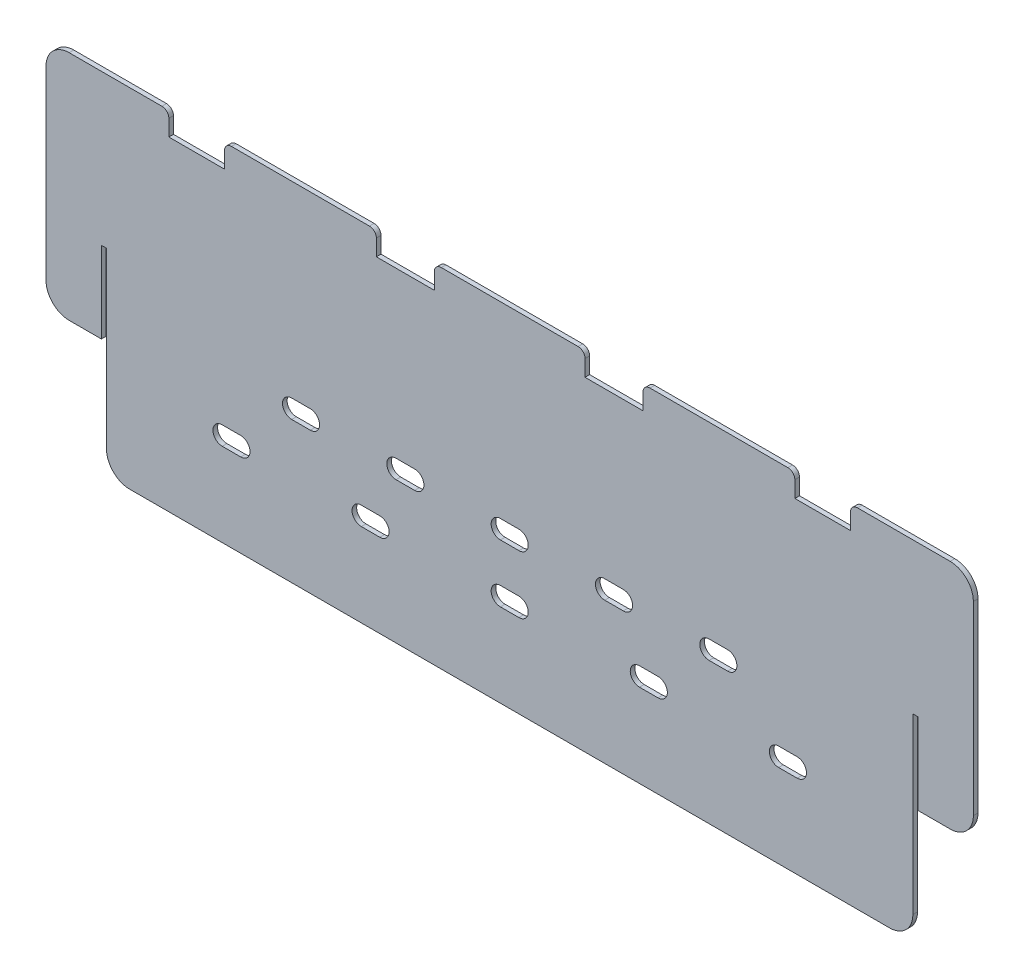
ISO-10303-21;
HEADER;
FILE_DESCRIPTION(('STEP AP214'),'2;1');
FILE_NAME('part.step','',(''),(''),'','','');
FILE_SCHEMA(('AUTOMOTIVE_DESIGN { 1 0 10303 214 1 1 1 1 }'));
ENDSEC;
DATA;
#1=APPLICATION_CONTEXT('core data for automotive mechanical design processes');
#2=APPLICATION_PROTOCOL_DEFINITION('international standard','automotive_design',2000,#1);
#3=PRODUCT_CONTEXT('',#1,'mechanical');
#4=PRODUCT('Part','Part','',(#3));
#5=PRODUCT_RELATED_PRODUCT_CATEGORY('part','',(#4));
#6=PRODUCT_DEFINITION_FORMATION('','',#4);
#7=PRODUCT_DEFINITION_CONTEXT('part definition',#1,'design');
#8=PRODUCT_DEFINITION('design','',#6,#7);
#9=PRODUCT_DEFINITION_SHAPE('','',#8);
#10=(LENGTH_UNIT() NAMED_UNIT(*) SI_UNIT(.MILLI.,.METRE.));
#11=(NAMED_UNIT(*) PLANE_ANGLE_UNIT() SI_UNIT($,.RADIAN.));
#12=(NAMED_UNIT(*) SI_UNIT($,.STERADIAN.) SOLID_ANGLE_UNIT());
#13=UNCERTAINTY_MEASURE_WITH_UNIT(LENGTH_MEASURE(1.E-05),#10,'distance_accuracy_value','');
#14=(GEOMETRIC_REPRESENTATION_CONTEXT(3) GLOBAL_UNCERTAINTY_ASSIGNED_CONTEXT((#13)) GLOBAL_UNIT_ASSIGNED_CONTEXT((#10,
#11,#12)) REPRESENTATION_CONTEXT('',''));
#15=CARTESIAN_POINT('',(0.,0.,0.));
#16=DIRECTION('',(0.,0.,1.));
#17=DIRECTION('',(1.,0.,0.));
#18=AXIS2_PLACEMENT_3D('',#15,#16,#17);
#19=CARTESIAN_POINT('',(0.,150.,-2.));
#20=DIRECTION('',(0.,1.,0.));
#21=DIRECTION('',(0.,0.,1.));
#22=AXIS2_PLACEMENT_3D('',#19,#20,#21);
#23=PLANE('',#22);
#24=DIRECTION('',(-1.,0.,0.));
#25=VECTOR('',#24,1.);
#26=CARTESIAN_POINT('',(0.,150.,0.));
#27=LINE('',#26,#25);
#28=CARTESIAN_POINT('',(50.,150.,0.));
#29=VERTEX_POINT('',#28);
#30=CARTESIAN_POINT('',(10.,150.,0.));
#31=VERTEX_POINT('',#30);
#32=EDGE_CURVE('E1003',#29,#31,#27,.T.);
#33=ORIENTED_EDGE('',*,*,#32,.F.);
#34=DIRECTION('',(0.,0.,1.));
#35=VECTOR('',#34,1.);
#36=CARTESIAN_POINT('',(50.,150.,-2.));
#37=LINE('',#36,#35);
#38=CARTESIAN_POINT('',(50.,150.,-2.));
#39=VERTEX_POINT('',#38);
#40=EDGE_CURVE('E1110',#29,#39,#37,.F.);
#41=ORIENTED_EDGE('',*,*,#40,.T.);
#42=DIRECTION('',(-1.,0.,0.));
#43=VECTOR('',#42,1.);
#44=CARTESIAN_POINT('',(0.,150.,-2.));
#45=LINE('',#44,#43);
#46=CARTESIAN_POINT('',(10.,150.,-2.));
#47=VERTEX_POINT('',#46);
#48=EDGE_CURVE('E990',#39,#47,#45,.T.);
#49=ORIENTED_EDGE('',*,*,#48,.T.);
#50=DIRECTION('',(0.,0.,1.));
#51=VECTOR('',#50,1.);
#52=CARTESIAN_POINT('',(10.,150.,-2.));
#53=LINE('',#52,#51);
#54=EDGE_CURVE('E1059',#47,#31,#53,.T.);
#55=ORIENTED_EDGE('',*,*,#54,.T.);
#56=EDGE_LOOP('',(#33,#41,#49,#55));
#57=FACE_BOUND('',#56,.T.);
#58=ADVANCED_FACE('F37',(#57),#23,.T.);
#59=CARTESIAN_POINT('',(229.5,150.,-2.));
#60=VERTEX_POINT('',#59);
#61=CARTESIAN_POINT('',(170.5,150.,-2.));
#62=VERTEX_POINT('',#61);
#63=EDGE_CURVE('E1173',#60,#62,#45,.T.);
#64=ORIENTED_EDGE('',*,*,#63,.T.);
#65=DIRECTION('',(0.,0.,1.));
#66=VECTOR('',#65,1.);
#67=CARTESIAN_POINT('',(170.5,150.,0.));
#68=LINE('',#67,#66);
#69=CARTESIAN_POINT('',(170.5,150.,0.));
#70=VERTEX_POINT('',#69);
#71=EDGE_CURVE('E1114',#62,#70,#68,.T.);
#72=ORIENTED_EDGE('',*,*,#71,.T.);
#73=CARTESIAN_POINT('',(229.5,150.,0.));
#74=VERTEX_POINT('',#73);
#75=EDGE_CURVE('E1157',#74,#70,#27,.T.);
#76=ORIENTED_EDGE('',*,*,#75,.F.);
#77=DIRECTION('',(0.,0.,1.));
#78=VECTOR('',#77,1.);
#79=CARTESIAN_POINT('',(229.5,150.,-2.));
#80=LINE('',#79,#78);
#81=EDGE_CURVE('E1112',#74,#60,#80,.F.);
#82=ORIENTED_EDGE('',*,*,#81,.T.);
#83=EDGE_LOOP('',(#64,#72,#76,#82));
#84=FACE_BOUND('',#83,.T.);
#85=ADVANCED_FACE('F1310',(#84),#23,.T.);
#86=CARTESIAN_POINT('',(139.5,150.,-2.));
#87=VERTEX_POINT('',#86);
#88=CARTESIAN_POINT('',(80.,150.,-2.));
#89=VERTEX_POINT('',#88);
#90=EDGE_CURVE('E995',#87,#89,#45,.T.);
#91=ORIENTED_EDGE('',*,*,#90,.T.);
#92=DIRECTION('',(0.,0.,1.));
#93=VECTOR('',#92,1.);
#94=CARTESIAN_POINT('',(80.,150.,0.));
#95=LINE('',#94,#93);
#96=CARTESIAN_POINT('',(80.,150.,0.));
#97=VERTEX_POINT('',#96);
#98=EDGE_CURVE('E1071',#89,#97,#95,.T.);
#99=ORIENTED_EDGE('',*,*,#98,.T.);
#100=CARTESIAN_POINT('',(139.5,150.,0.));
#101=VERTEX_POINT('',#100);
#102=EDGE_CURVE('E1007',#101,#97,#27,.T.);
#103=ORIENTED_EDGE('',*,*,#102,.F.);
#104=DIRECTION('',(0.,0.,1.));
#105=VECTOR('',#104,1.);
#106=CARTESIAN_POINT('',(139.5,150.,-2.));
#107=LINE('',#106,#105);
#108=EDGE_CURVE('E1069',#101,#87,#107,.F.);
#109=ORIENTED_EDGE('',*,*,#108,.T.);
#110=EDGE_LOOP('',(#91,#99,#103,#109));
#111=FACE_BOUND('',#110,.T.);
#112=ADVANCED_FACE('F1276',(#111),#23,.T.);
#113=CARTESIAN_POINT('',(390.,150.,-2.));
#114=VERTEX_POINT('',#113);
#115=CARTESIAN_POINT('',(350.,150.,-2.));
#116=VERTEX_POINT('',#115);
#117=EDGE_CURVE('E991',#114,#116,#45,.T.);
#118=ORIENTED_EDGE('',*,*,#117,.T.);
#119=DIRECTION('',(0.,0.,1.));
#120=VECTOR('',#119,1.);
#121=CARTESIAN_POINT('',(350.,150.,0.));
#122=LINE('',#121,#120);
#123=CARTESIAN_POINT('',(350.,150.,0.));
#124=VERTEX_POINT('',#123);
#125=EDGE_CURVE('E1122',#116,#124,#122,.T.);
#126=ORIENTED_EDGE('',*,*,#125,.T.);
#127=CARTESIAN_POINT('',(390.,150.,0.));
#128=VERTEX_POINT('',#127);
#129=EDGE_CURVE('E984',#128,#124,#27,.T.);
#130=ORIENTED_EDGE('',*,*,#129,.F.);
#131=DIRECTION('',(0.,0.,1.));
#132=VECTOR('',#131,1.);
#133=CARTESIAN_POINT('',(390.,150.,-2.));
#134=LINE('',#133,#132);
#135=EDGE_CURVE('E1067',#128,#114,#134,.F.);
#136=ORIENTED_EDGE('',*,*,#135,.T.);
#137=EDGE_LOOP('',(#118,#126,#130,#136));
#138=FACE_BOUND('',#137,.T.);
#139=ADVANCED_FACE('F1249',(#138),#23,.T.);
#140=CARTESIAN_POINT('',(0.,0.,-2.));
#141=DIRECTION('',(-1.,0.,0.));
#142=DIRECTION('',(0.,0.,1.));
#143=AXIS2_PLACEMENT_3D('',#140,#141,#142);
#144=PLANE('',#143);
#145=DIRECTION('',(0.,-1.,0.));
#146=VECTOR('',#145,1.);
#147=CARTESIAN_POINT('',(0.,0.,0.));
#148=LINE('',#147,#146);
#149=CARTESIAN_POINT('',(0.,140.,0.));
#150=VERTEX_POINT('',#149);
#151=CARTESIAN_POINT('',(0.,60.,0.));
#152=VERTEX_POINT('',#151);
#153=EDGE_CURVE('E980',#150,#152,#148,.T.);
#154=ORIENTED_EDGE('',*,*,#153,.F.);
#155=DIRECTION('',(0.,0.,1.));
#156=VECTOR('',#155,1.);
#157=CARTESIAN_POINT('',(0.,140.,-2.));
#158=LINE('',#157,#156);
#159=CARTESIAN_POINT('',(0.,140.,-2.));
#160=VERTEX_POINT('',#159);
#161=EDGE_CURVE('E1062',#150,#160,#158,.F.);
#162=ORIENTED_EDGE('',*,*,#161,.T.);
#163=DIRECTION('',(0.,-1.,0.));
#164=VECTOR('',#163,1.);
#165=CARTESIAN_POINT('',(0.,0.,-2.));
#166=LINE('',#165,#164);
#167=CARTESIAN_POINT('',(0.,60.,-2.));
#168=VERTEX_POINT('',#167);
#169=EDGE_CURVE('E981',#160,#168,#166,.T.);
#170=ORIENTED_EDGE('',*,*,#169,.T.);
#171=DIRECTION('',(0.,0.,1.));
#172=VECTOR('',#171,1.);
#173=CARTESIAN_POINT('',(0.,60.,0.));
#174=LINE('',#173,#172);
#175=EDGE_CURVE('E1027',#168,#152,#174,.T.);
#176=ORIENTED_EDGE('',*,*,#175,.T.);
#177=EDGE_LOOP('',(#154,#162,#170,#176));
#178=FACE_BOUND('',#177,.T.);
#179=ADVANCED_FACE('F1179',(#178),#144,.T.);
#180=CARTESIAN_POINT('',(320.,150.,0.));
#181=VERTEX_POINT('',#180);
#182=CARTESIAN_POINT('',(260.5,150.,0.));
#183=VERTEX_POINT('',#182);
#184=EDGE_CURVE('E1006',#181,#183,#27,.T.);
#185=ORIENTED_EDGE('',*,*,#184,.F.);
#186=DIRECTION('',(0.,0.,1.));
#187=VECTOR('',#186,1.);
#188=CARTESIAN_POINT('',(320.,150.,-2.));
#189=LINE('',#188,#187);
#190=CARTESIAN_POINT('',(320.,150.,-2.));
#191=VERTEX_POINT('',#190);
#192=EDGE_CURVE('E1132',#181,#191,#189,.F.);
#193=ORIENTED_EDGE('',*,*,#192,.T.);
#194=CARTESIAN_POINT('',(260.5,150.,-2.));
#195=VERTEX_POINT('',#194);
#196=EDGE_CURVE('E994',#191,#195,#45,.T.);
#197=ORIENTED_EDGE('',*,*,#196,.T.);
#198=DIRECTION('',(0.,0.,1.));
#199=VECTOR('',#198,1.);
#200=CARTESIAN_POINT('',(260.5,150.,0.));
#201=LINE('',#200,#199);
#202=EDGE_CURVE('E1129',#195,#183,#201,.T.);
#203=ORIENTED_EDGE('',*,*,#202,.T.);
#204=EDGE_LOOP('',(#185,#193,#197,#203));
#205=FACE_BOUND('',#204,.T.);
#206=ADVANCED_FACE('F1152',(#205),#23,.T.);
#207=CARTESIAN_POINT('',(400.,0.,-2.));
#208=DIRECTION('',(1.,0.,0.));
#209=DIRECTION('',(0.,0.,-1.));
#210=AXIS2_PLACEMENT_3D('',#207,#208,#209);
#211=PLANE('',#210);
#212=DIRECTION('',(0.,1.,0.));
#213=VECTOR('',#212,1.);
#214=CARTESIAN_POINT('',(400.,0.,-2.));
#215=LINE('',#214,#213);
#216=CARTESIAN_POINT('',(400.,60.,-2.));
#217=VERTEX_POINT('',#216);
#218=CARTESIAN_POINT('',(400.,140.,-2.));
#219=VERTEX_POINT('',#218);
#220=EDGE_CURVE('E987',#217,#219,#215,.T.);
#221=ORIENTED_EDGE('',*,*,#220,.T.);
#222=DIRECTION('',(0.,0.,1.));
#223=VECTOR('',#222,1.);
#224=CARTESIAN_POINT('',(400.,140.,-2.));
#225=LINE('',#224,#223);
#226=CARTESIAN_POINT('',(400.,140.,0.));
#227=VERTEX_POINT('',#226);
#228=EDGE_CURVE('E1064',#219,#227,#225,.T.);
#229=ORIENTED_EDGE('',*,*,#228,.T.);
#230=DIRECTION('',(0.,1.,0.));
#231=VECTOR('',#230,1.);
#232=CARTESIAN_POINT('',(400.,0.,0.));
#233=LINE('',#232,#231);
#234=CARTESIAN_POINT('',(400.,60.,0.));
#235=VERTEX_POINT('',#234);
#236=EDGE_CURVE('E1000',#235,#227,#233,.T.);
#237=ORIENTED_EDGE('',*,*,#236,.F.);
#238=DIRECTION('',(0.,0.,1.));
#239=VECTOR('',#238,1.);
#240=CARTESIAN_POINT('',(400.,60.,-2.));
#241=LINE('',#240,#239);
#242=EDGE_CURVE('E1020',#235,#217,#241,.F.);
#243=ORIENTED_EDGE('',*,*,#242,.T.);
#244=EDGE_LOOP('',(#221,#229,#237,#243));
#245=FACE_BOUND('',#244,.T.);
#246=ADVANCED_FACE('F1241',(#245),#211,.T.);
#247=CARTESIAN_POINT('',(0.,0.,-2.));
#248=DIRECTION('',(0.,-1.,0.));
#249=DIRECTION('',(0.,0.,-1.));
#250=AXIS2_PLACEMENT_3D('',#247,#248,#249);
#251=PLANE('',#250);
#252=DIRECTION('',(1.,0.,0.));
#253=VECTOR('',#252,1.);
#254=CARTESIAN_POINT('',(0.,0.,-2.));
#255=LINE('',#254,#253);
#256=CARTESIAN_POINT('',(36.1,0.,-2.));
#257=VERTEX_POINT('',#256);
#258=CARTESIAN_POINT('',(363.9,0.,-2.));
#259=VERTEX_POINT('',#258);
#260=EDGE_CURVE('E983',#257,#259,#255,.T.);
#261=ORIENTED_EDGE('',*,*,#260,.T.);
#262=DIRECTION('',(0.,0.,1.));
#263=VECTOR('',#262,1.);
#264=CARTESIAN_POINT('',(363.9,0.,0.));
#265=LINE('',#264,#263);
#266=CARTESIAN_POINT('',(363.9,0.,0.));
#267=VERTEX_POINT('',#266);
#268=EDGE_CURVE('E1034',#259,#267,#265,.T.);
#269=ORIENTED_EDGE('',*,*,#268,.T.);
#270=DIRECTION('',(1.,0.,0.));
#271=VECTOR('',#270,1.);
#272=CARTESIAN_POINT('',(0.,0.,0.));
#273=LINE('',#272,#271);
#274=CARTESIAN_POINT('',(36.1,0.,0.));
#275=VERTEX_POINT('',#274);
#276=EDGE_CURVE('E997',#275,#267,#273,.T.);
#277=ORIENTED_EDGE('',*,*,#276,.F.);
#278=DIRECTION('',(0.,0.,1.));
#279=VECTOR('',#278,1.);
#280=CARTESIAN_POINT('',(36.1,0.,-2.));
#281=LINE('',#280,#279);
#282=EDGE_CURVE('E1032',#275,#257,#281,.F.);
#283=ORIENTED_EDGE('',*,*,#282,.T.);
#284=EDGE_LOOP('',(#261,#269,#277,#283));
#285=FACE_BOUND('',#284,.T.);
#286=ADVANCED_FACE('F1209',(#285),#251,.T.);
#287=CARTESIAN_POINT('',(0.,0.,-2.));
#288=DIRECTION('',(0.,0.,-1.));
#289=DIRECTION('',(-1.,0.,0.));
#290=AXIS2_PLACEMENT_3D('',#287,#288,#289);
#291=PLANE('',#290);
#292=CARTESIAN_POINT('',(76.,40.,-2.));
#293=DIRECTION('',(0.,0.,-1.));
#294=DIRECTION('',(-1.,0.,0.));
#295=AXIS2_PLACEMENT_3D('',#292,#293,#294);
#296=CIRCLE('',#295,4.);
#297=CARTESIAN_POINT('',(76.,36.,-2.));
#298=VERTEX_POINT('',#297);
#299=CARTESIAN_POINT('',(76.,44.,-2.));
#300=VERTEX_POINT('',#299);
#301=EDGE_CURVE('E849',#298,#300,#296,.T.);
#302=ORIENTED_EDGE('',*,*,#301,.F.);
#303=DIRECTION('',(-1.,0.,0.));
#304=VECTOR('',#303,1.);
#305=CARTESIAN_POINT('',(0.,36.0000000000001,-2.));
#306=LINE('',#305,#304);
#307=CARTESIAN_POINT('',(84.,36.,-2.));
#308=VERTEX_POINT('',#307);
#309=EDGE_CURVE('E844',#308,#298,#306,.T.);
#310=ORIENTED_EDGE('',*,*,#309,.F.);
#311=CARTESIAN_POINT('',(84.,40.,-2.));
#312=DIRECTION('',(0.,0.,-1.));
#313=DIRECTION('',(-1.,0.,0.));
#314=AXIS2_PLACEMENT_3D('',#311,#312,#313);
#315=CIRCLE('',#314,4.);
#316=CARTESIAN_POINT('',(84.,44.,-2.));
#317=VERTEX_POINT('',#316);
#318=EDGE_CURVE('E556',#317,#308,#315,.T.);
#319=ORIENTED_EDGE('',*,*,#318,.F.);
#320=DIRECTION('',(1.,0.,0.));
#321=VECTOR('',#320,1.);
#322=CARTESIAN_POINT('',(0.,44.,-2.));
#323=LINE('',#322,#321);
#324=EDGE_CURVE('E847',#300,#317,#323,.T.);
#325=ORIENTED_EDGE('',*,*,#324,.F.);
#326=EDGE_LOOP('',(#302,#310,#319,#325));
#327=FACE_BOUND('',#326,.T.);
#328=CARTESIAN_POINT('',(286.,65.,-2.));
#329=DIRECTION('',(0.,0.,-1.));
#330=DIRECTION('',(-1.,0.,0.));
#331=AXIS2_PLACEMENT_3D('',#328,#329,#330);
#332=CIRCLE('',#331,3.99999999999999);
#333=CARTESIAN_POINT('',(286.,61.,-2.));
#334=VERTEX_POINT('',#333);
#335=CARTESIAN_POINT('',(286.,69.,-2.));
#336=VERTEX_POINT('',#335);
#337=EDGE_CURVE('E842',#334,#336,#332,.T.);
#338=ORIENTED_EDGE('',*,*,#337,.F.);
#339=DIRECTION('',(-1.,0.,0.));
#340=VECTOR('',#339,1.);
#341=CARTESIAN_POINT('',(0.,61.,-2.));
#342=LINE('',#341,#340);
#343=CARTESIAN_POINT('',(294.,61.,-2.));
#344=VERTEX_POINT('',#343);
#345=EDGE_CURVE('E835',#344,#334,#342,.T.);
#346=ORIENTED_EDGE('',*,*,#345,.F.);
#347=CARTESIAN_POINT('',(294.,65.,-2.));
#348=DIRECTION('',(0.,0.,-1.));
#349=DIRECTION('',(-1.,0.,0.));
#350=AXIS2_PLACEMENT_3D('',#347,#348,#349);
#351=CIRCLE('',#350,3.99999999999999);
#352=CARTESIAN_POINT('',(294.,69.,-2.));
#353=VERTEX_POINT('',#352);
#354=EDGE_CURVE('E837',#353,#344,#351,.T.);
#355=ORIENTED_EDGE('',*,*,#354,.F.);
#356=DIRECTION('',(1.,0.,0.));
#357=VECTOR('',#356,1.);
#358=CARTESIAN_POINT('',(0.,69.,-2.));
#359=LINE('',#358,#357);
#360=EDGE_CURVE('E840',#336,#353,#359,.T.);
#361=ORIENTED_EDGE('',*,*,#360,.F.);
#362=EDGE_LOOP('',(#338,#346,#355,#361));
#363=FACE_BOUND('',#362,.T.);
#364=CARTESIAN_POINT('',(241.,65.,-2.));
#365=DIRECTION('',(0.,0.,-1.));
#366=DIRECTION('',(-1.,0.,0.));
#367=AXIS2_PLACEMENT_3D('',#364,#365,#366);
#368=CIRCLE('',#367,3.99999999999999);
#369=CARTESIAN_POINT('',(241.,61.,-2.));
#370=VERTEX_POINT('',#369);
#371=CARTESIAN_POINT('',(241.,69.,-2.));
#372=VERTEX_POINT('',#371);
#373=EDGE_CURVE('E833',#370,#372,#368,.T.);
#374=ORIENTED_EDGE('',*,*,#373,.F.);
#375=DIRECTION('',(-1.,0.,0.));
#376=VECTOR('',#375,1.);
#377=CARTESIAN_POINT('',(0.,61.,-2.));
#378=LINE('',#377,#376);
#379=CARTESIAN_POINT('',(249.,61.,-2.));
#380=VERTEX_POINT('',#379);
#381=EDGE_CURVE('E826',#380,#370,#378,.T.);
#382=ORIENTED_EDGE('',*,*,#381,.F.);
#383=CARTESIAN_POINT('',(249.,65.,-2.));
#384=DIRECTION('',(0.,0.,-1.));
#385=DIRECTION('',(-1.,0.,0.));
#386=AXIS2_PLACEMENT_3D('',#383,#384,#385);
#387=CIRCLE('',#386,3.99999999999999);
#388=CARTESIAN_POINT('',(249.,69.,-2.));
#389=VERTEX_POINT('',#388);
#390=EDGE_CURVE('E828',#389,#380,#387,.T.);
#391=ORIENTED_EDGE('',*,*,#390,.F.);
#392=DIRECTION('',(1.,0.,0.));
#393=VECTOR('',#392,1.);
#394=CARTESIAN_POINT('',(0.,69.,-2.));
#395=LINE('',#394,#393);
#396=EDGE_CURVE('E831',#372,#389,#395,.T.);
#397=ORIENTED_EDGE('',*,*,#396,.F.);
#398=EDGE_LOOP('',(#374,#382,#391,#397));
#399=FACE_BOUND('',#398,.T.);
#400=CARTESIAN_POINT('',(196.,65.,-2.));
#401=DIRECTION('',(0.,0.,-1.));
#402=DIRECTION('',(-1.,0.,0.));
#403=AXIS2_PLACEMENT_3D('',#400,#401,#402);
#404=CIRCLE('',#403,3.99999999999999);
#405=CARTESIAN_POINT('',(196.,61.,-2.));
#406=VERTEX_POINT('',#405);
#407=CARTESIAN_POINT('',(196.,69.,-2.));
#408=VERTEX_POINT('',#407);
#409=EDGE_CURVE('E824',#406,#408,#404,.T.);
#410=ORIENTED_EDGE('',*,*,#409,.F.);
#411=DIRECTION('',(-1.,0.,0.));
#412=VECTOR('',#411,1.);
#413=CARTESIAN_POINT('',(0.,61.,-2.));
#414=LINE('',#413,#412);
#415=CARTESIAN_POINT('',(204.,61.,-2.));
#416=VERTEX_POINT('',#415);
#417=EDGE_CURVE('E817',#416,#406,#414,.T.);
#418=ORIENTED_EDGE('',*,*,#417,.F.);
#419=CARTESIAN_POINT('',(204.,65.,-2.));
#420=DIRECTION('',(0.,0.,-1.));
#421=DIRECTION('',(-1.,0.,0.));
#422=AXIS2_PLACEMENT_3D('',#419,#420,#421);
#423=CIRCLE('',#422,3.99999999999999);
#424=CARTESIAN_POINT('',(204.,69.,-2.));
#425=VERTEX_POINT('',#424);
#426=EDGE_CURVE('E819',#425,#416,#423,.T.);
#427=ORIENTED_EDGE('',*,*,#426,.F.);
#428=DIRECTION('',(1.,0.,0.));
#429=VECTOR('',#428,1.);
#430=CARTESIAN_POINT('',(0.,69.,-2.));
#431=LINE('',#430,#429);
#432=EDGE_CURVE('E822',#408,#425,#431,.T.);
#433=ORIENTED_EDGE('',*,*,#432,.F.);
#434=EDGE_LOOP('',(#410,#418,#427,#433));
#435=FACE_BOUND('',#434,.T.);
#436=CARTESIAN_POINT('',(151.,65.,-2.));
#437=DIRECTION('',(0.,0.,-1.));
#438=DIRECTION('',(-1.,0.,0.));
#439=AXIS2_PLACEMENT_3D('',#436,#437,#438);
#440=CIRCLE('',#439,3.99999999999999);
#441=CARTESIAN_POINT('',(151.,61.,-2.));
#442=VERTEX_POINT('',#441);
#443=CARTESIAN_POINT('',(151.,69.,-2.));
#444=VERTEX_POINT('',#443);
#445=EDGE_CURVE('E815',#442,#444,#440,.T.);
#446=ORIENTED_EDGE('',*,*,#445,.F.);
#447=DIRECTION('',(-1.,0.,0.));
#448=VECTOR('',#447,1.);
#449=CARTESIAN_POINT('',(0.,61.,-2.));
#450=LINE('',#449,#448);
#451=CARTESIAN_POINT('',(159.,61.,-2.));
#452=VERTEX_POINT('',#451);
#453=EDGE_CURVE('E808',#452,#442,#450,.T.);
#454=ORIENTED_EDGE('',*,*,#453,.F.);
#455=CARTESIAN_POINT('',(159.,65.,-2.));
#456=DIRECTION('',(0.,0.,-1.));
#457=DIRECTION('',(-1.,0.,0.));
#458=AXIS2_PLACEMENT_3D('',#455,#456,#457);
#459=CIRCLE('',#458,3.99999999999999);
#460=CARTESIAN_POINT('',(159.,69.,-2.));
#461=VERTEX_POINT('',#460);
#462=EDGE_CURVE('E810',#461,#452,#459,.T.);
#463=ORIENTED_EDGE('',*,*,#462,.F.);
#464=DIRECTION('',(1.,0.,0.));
#465=VECTOR('',#464,1.);
#466=CARTESIAN_POINT('',(0.,69.,-2.));
#467=LINE('',#466,#465);
#468=EDGE_CURVE('E813',#444,#461,#467,.T.);
#469=ORIENTED_EDGE('',*,*,#468,.F.);
#470=EDGE_LOOP('',(#446,#454,#463,#469));
#471=FACE_BOUND('',#470,.T.);
#472=CARTESIAN_POINT('',(106.,65.,-2.));
#473=DIRECTION('',(0.,0.,-1.));
#474=DIRECTION('',(-1.,0.,0.));
#475=AXIS2_PLACEMENT_3D('',#472,#473,#474);
#476=CIRCLE('',#475,3.99999999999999);
#477=CARTESIAN_POINT('',(106.,61.,-2.));
#478=VERTEX_POINT('',#477);
#479=CARTESIAN_POINT('',(106.,69.,-2.));
#480=VERTEX_POINT('',#479);
#481=EDGE_CURVE('E806',#478,#480,#476,.T.);
#482=ORIENTED_EDGE('',*,*,#481,.F.);
#483=DIRECTION('',(-1.,0.,0.));
#484=VECTOR('',#483,1.);
#485=CARTESIAN_POINT('',(0.,61.,-2.));
#486=LINE('',#485,#484);
#487=CARTESIAN_POINT('',(114.,61.,-2.));
#488=VERTEX_POINT('',#487);
#489=EDGE_CURVE('E799',#488,#478,#486,.T.);
#490=ORIENTED_EDGE('',*,*,#489,.F.);
#491=CARTESIAN_POINT('',(114.,65.,-2.));
#492=DIRECTION('',(0.,0.,-1.));
#493=DIRECTION('',(-1.,0.,0.));
#494=AXIS2_PLACEMENT_3D('',#491,#492,#493);
#495=CIRCLE('',#494,3.99999999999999);
#496=CARTESIAN_POINT('',(114.,69.,-2.));
#497=VERTEX_POINT('',#496);
#498=EDGE_CURVE('E801',#497,#488,#495,.T.);
#499=ORIENTED_EDGE('',*,*,#498,.F.);
#500=DIRECTION('',(1.,0.,0.));
#501=VECTOR('',#500,1.);
#502=CARTESIAN_POINT('',(0.,69.,-2.));
#503=LINE('',#502,#501);
#504=EDGE_CURVE('E804',#480,#497,#503,.T.);
#505=ORIENTED_EDGE('',*,*,#504,.F.);
#506=EDGE_LOOP('',(#482,#490,#499,#505));
#507=FACE_BOUND('',#506,.T.);
#508=CARTESIAN_POINT('',(316.,40.,-2.));
#509=DIRECTION('',(0.,0.,-1.));
#510=DIRECTION('',(-1.,0.,0.));
#511=AXIS2_PLACEMENT_3D('',#508,#509,#510);
#512=CIRCLE('',#511,3.99999999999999);
#513=CARTESIAN_POINT('',(316.,36.,-2.));
#514=VERTEX_POINT('',#513);
#515=CARTESIAN_POINT('',(316.,44.,-2.));
#516=VERTEX_POINT('',#515);
#517=EDGE_CURVE('E797',#514,#516,#512,.T.);
#518=ORIENTED_EDGE('',*,*,#517,.F.);
#519=DIRECTION('',(-1.,0.,0.));
#520=VECTOR('',#519,1.);
#521=CARTESIAN_POINT('',(0.,36.,-2.));
#522=LINE('',#521,#520);
#523=CARTESIAN_POINT('',(324.,36.,-2.));
#524=VERTEX_POINT('',#523);
#525=EDGE_CURVE('E790',#524,#514,#522,.T.);
#526=ORIENTED_EDGE('',*,*,#525,.F.);
#527=CARTESIAN_POINT('',(324.,40.,-2.));
#528=DIRECTION('',(0.,0.,-1.));
#529=DIRECTION('',(-1.,0.,0.));
#530=AXIS2_PLACEMENT_3D('',#527,#528,#529);
#531=CIRCLE('',#530,3.99999999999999);
#532=CARTESIAN_POINT('',(324.,44.,-2.));
#533=VERTEX_POINT('',#532);
#534=EDGE_CURVE('E792',#533,#524,#531,.T.);
#535=ORIENTED_EDGE('',*,*,#534,.F.);
#536=DIRECTION('',(1.,0.,0.));
#537=VECTOR('',#536,1.);
#538=CARTESIAN_POINT('',(0.,44.,-2.));
#539=LINE('',#538,#537);
#540=EDGE_CURVE('E795',#516,#533,#539,.T.);
#541=ORIENTED_EDGE('',*,*,#540,.F.);
#542=EDGE_LOOP('',(#518,#526,#535,#541));
#543=FACE_BOUND('',#542,.T.);
#544=CARTESIAN_POINT('',(256.,40.,-2.));
#545=DIRECTION('',(0.,0.,-1.));
#546=DIRECTION('',(-1.,0.,0.));
#547=AXIS2_PLACEMENT_3D('',#544,#545,#546);
#548=CIRCLE('',#547,4.);
#549=CARTESIAN_POINT('',(256.,36.,-2.));
#550=VERTEX_POINT('',#549);
#551=CARTESIAN_POINT('',(256.,44.,-2.));
#552=VERTEX_POINT('',#551);
#553=EDGE_CURVE('E788',#550,#552,#548,.T.);
#554=ORIENTED_EDGE('',*,*,#553,.F.);
#555=DIRECTION('',(-1.,0.,0.));
#556=VECTOR('',#555,1.);
#557=CARTESIAN_POINT('',(0.,36.,-2.));
#558=LINE('',#557,#556);
#559=CARTESIAN_POINT('',(264.,36.,-2.));
#560=VERTEX_POINT('',#559);
#561=EDGE_CURVE('E781',#560,#550,#558,.T.);
#562=ORIENTED_EDGE('',*,*,#561,.F.);
#563=CARTESIAN_POINT('',(264.,40.,-2.));
#564=DIRECTION('',(0.,0.,-1.));
#565=DIRECTION('',(-1.,0.,0.));
#566=AXIS2_PLACEMENT_3D('',#563,#564,#565);
#567=CIRCLE('',#566,4.);
#568=CARTESIAN_POINT('',(264.,44.,-2.));
#569=VERTEX_POINT('',#568);
#570=EDGE_CURVE('E783',#569,#560,#567,.T.);
#571=ORIENTED_EDGE('',*,*,#570,.F.);
#572=DIRECTION('',(1.,0.,0.));
#573=VECTOR('',#572,1.);
#574=CARTESIAN_POINT('',(0.,44.,-2.));
#575=LINE('',#574,#573);
#576=EDGE_CURVE('E786',#552,#569,#575,.T.);
#577=ORIENTED_EDGE('',*,*,#576,.F.);
#578=EDGE_LOOP('',(#554,#562,#571,#577));
#579=FACE_BOUND('',#578,.T.);
#580=CARTESIAN_POINT('',(196.,40.,-2.));
#581=DIRECTION('',(0.,0.,-1.));
#582=DIRECTION('',(-1.,0.,0.));
#583=AXIS2_PLACEMENT_3D('',#580,#581,#582);
#584=CIRCLE('',#583,3.99999999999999);
#585=CARTESIAN_POINT('',(196.,36.,-2.));
#586=VERTEX_POINT('',#585);
#587=CARTESIAN_POINT('',(196.,44.,-2.));
#588=VERTEX_POINT('',#587);
#589=EDGE_CURVE('E779',#586,#588,#584,.T.);
#590=ORIENTED_EDGE('',*,*,#589,.F.);
#591=DIRECTION('',(-1.,0.,0.));
#592=VECTOR('',#591,1.);
#593=CARTESIAN_POINT('',(0.,36.,-2.));
#594=LINE('',#593,#592);
#595=CARTESIAN_POINT('',(204.,36.,-2.));
#596=VERTEX_POINT('',#595);
#597=EDGE_CURVE('E772',#596,#586,#594,.T.);
#598=ORIENTED_EDGE('',*,*,#597,.F.);
#599=CARTESIAN_POINT('',(204.,40.,-2.));
#600=DIRECTION('',(0.,0.,-1.));
#601=DIRECTION('',(-1.,0.,0.));
#602=AXIS2_PLACEMENT_3D('',#599,#600,#601);
#603=CIRCLE('',#602,3.99999999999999);
#604=CARTESIAN_POINT('',(204.,44.,-2.));
#605=VERTEX_POINT('',#604);
#606=EDGE_CURVE('E774',#605,#596,#603,.T.);
#607=ORIENTED_EDGE('',*,*,#606,.F.);
#608=DIRECTION('',(1.,0.,0.));
#609=VECTOR('',#608,1.);
#610=CARTESIAN_POINT('',(0.,44.,-2.));
#611=LINE('',#610,#609);
#612=EDGE_CURVE('E777',#588,#605,#611,.T.);
#613=ORIENTED_EDGE('',*,*,#612,.F.);
#614=EDGE_LOOP('',(#590,#598,#607,#613));
#615=FACE_BOUND('',#614,.T.);
#616=CARTESIAN_POINT('',(136.,40.,-2.));
#617=DIRECTION('',(0.,0.,-1.));
#618=DIRECTION('',(-1.,0.,0.));
#619=AXIS2_PLACEMENT_3D('',#616,#617,#618);
#620=CIRCLE('',#619,4.);
#621=CARTESIAN_POINT('',(136.,36.,-2.));
#622=VERTEX_POINT('',#621);
#623=CARTESIAN_POINT('',(136.,44.,-2.));
#624=VERTEX_POINT('',#623);
#625=EDGE_CURVE('E770',#622,#624,#620,.T.);
#626=ORIENTED_EDGE('',*,*,#625,.F.);
#627=DIRECTION('',(-1.,0.,0.));
#628=VECTOR('',#627,1.);
#629=CARTESIAN_POINT('',(0.,36.,-2.));
#630=LINE('',#629,#628);
#631=CARTESIAN_POINT('',(144.,36.,-2.));
#632=VERTEX_POINT('',#631);
#633=EDGE_CURVE('E581',#632,#622,#630,.T.);
#634=ORIENTED_EDGE('',*,*,#633,.F.);
#635=CARTESIAN_POINT('',(144.,40.,-2.));
#636=DIRECTION('',(0.,0.,-1.));
#637=DIRECTION('',(-1.,0.,0.));
#638=AXIS2_PLACEMENT_3D('',#635,#636,#637);
#639=CIRCLE('',#638,4.);
#640=CARTESIAN_POINT('',(144.,44.,-2.));
#641=VERTEX_POINT('',#640);
#642=EDGE_CURVE('E765',#641,#632,#639,.T.);
#643=ORIENTED_EDGE('',*,*,#642,.F.);
#644=DIRECTION('',(1.,0.,0.));
#645=VECTOR('',#644,1.);
#646=CARTESIAN_POINT('',(0.,44.,-2.));
#647=LINE('',#646,#645);
#648=EDGE_CURVE('E768',#624,#641,#647,.T.);
#649=ORIENTED_EDGE('',*,*,#648,.F.);
#650=EDGE_LOOP('',(#626,#634,#643,#649));
#651=FACE_BOUND('',#650,.T.);
#652=DIRECTION('',(0.,-1.,0.));
#653=VECTOR('',#652,1.);
#654=CARTESIAN_POINT('',(77.0000000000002,1.06858966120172E-13,-2.));
#655=LINE('',#654,#653);
#656=CARTESIAN_POINT('',(77.,147.,-2.));
#657=VERTEX_POINT('',#656);
#658=CARTESIAN_POINT('',(77.,140.,-2.));
#659=VERTEX_POINT('',#658);
#660=EDGE_CURVE('E935',#657,#659,#655,.T.);
#661=ORIENTED_EDGE('',*,*,#660,.F.);
#662=CARTESIAN_POINT('',(80.,147.,-2.));
#663=DIRECTION('',(0.,0.,-1.));
#664=DIRECTION('',(-1.,0.,0.));
#665=AXIS2_PLACEMENT_3D('',#662,#663,#664);
#666=CIRCLE('',#665,3.);
#667=EDGE_CURVE('E1105',#657,#89,#666,.T.);
#668=ORIENTED_EDGE('',*,*,#667,.T.);
#669=ORIENTED_EDGE('',*,*,#90,.F.);
#670=CARTESIAN_POINT('',(139.5,147.,-2.));
#671=DIRECTION('',(0.,0.,-1.));
#672=DIRECTION('',(-1.,0.,0.));
#673=AXIS2_PLACEMENT_3D('',#670,#671,#672);
#674=CIRCLE('',#673,3.);
#675=CARTESIAN_POINT('',(142.5,147.,-2.));
#676=VERTEX_POINT('',#675);
#677=EDGE_CURVE('E1099',#87,#676,#674,.T.);
#678=ORIENTED_EDGE('',*,*,#677,.T.);
#679=DIRECTION('',(0.,1.,0.));
#680=VECTOR('',#679,1.);
#681=CARTESIAN_POINT('',(142.5,0.,-2.));
#682=LINE('',#681,#680);
#683=CARTESIAN_POINT('',(142.5,140.,-2.));
#684=VERTEX_POINT('',#683);
#685=EDGE_CURVE('E926',#684,#676,#682,.T.);
#686=ORIENTED_EDGE('',*,*,#685,.F.);
#687=DIRECTION('',(-1.,0.,0.));
#688=VECTOR('',#687,1.);
#689=CARTESIAN_POINT('',(0.,140.,-2.));
#690=LINE('',#689,#688);
#691=CARTESIAN_POINT('',(167.5,140.,-2.));
#692=VERTEX_POINT('',#691);
#693=EDGE_CURVE('E929',#692,#684,#690,.T.);
#694=ORIENTED_EDGE('',*,*,#693,.F.);
#695=DIRECTION('',(0.,-1.,0.));
#696=VECTOR('',#695,1.);
#697=CARTESIAN_POINT('',(167.5,0.,-2.));
#698=LINE('',#697,#696);
#699=CARTESIAN_POINT('',(167.5,147.,-2.));
#700=VERTEX_POINT('',#699);
#701=EDGE_CURVE('E931',#700,#692,#698,.T.);
#702=ORIENTED_EDGE('',*,*,#701,.F.);
#703=CARTESIAN_POINT('',(170.5,147.,-2.));
#704=DIRECTION('',(0.,0.,-1.));
#705=DIRECTION('',(-1.,0.,0.));
#706=AXIS2_PLACEMENT_3D('',#703,#704,#705);
#707=CIRCLE('',#706,3.);
#708=EDGE_CURVE('E1101',#700,#62,#707,.T.);
#709=ORIENTED_EDGE('',*,*,#708,.T.);
#710=ORIENTED_EDGE('',*,*,#63,.F.);
#711=CARTESIAN_POINT('',(229.5,147.,-2.));
#712=DIRECTION('',(0.,0.,-1.));
#713=DIRECTION('',(-1.,0.,0.));
#714=AXIS2_PLACEMENT_3D('',#711,#712,#713);
#715=CIRCLE('',#714,3.);
#716=CARTESIAN_POINT('',(232.5,147.,-2.));
#717=VERTEX_POINT('',#716);
#718=EDGE_CURVE('E1092',#60,#717,#715,.T.);
#719=ORIENTED_EDGE('',*,*,#718,.T.);
#720=DIRECTION('',(0.,1.,0.));
#721=VECTOR('',#720,1.);
#722=CARTESIAN_POINT('',(232.5,0.,-2.));
#723=LINE('',#722,#721);
#724=CARTESIAN_POINT('',(232.5,140.,-2.));
#725=VERTEX_POINT('',#724);
#726=EDGE_CURVE('E923',#725,#717,#723,.T.);
#727=ORIENTED_EDGE('',*,*,#726,.F.);
#728=DIRECTION('',(-1.,0.,0.));
#729=VECTOR('',#728,1.);
#730=CARTESIAN_POINT('',(-1.55431223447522E-13,140.,-2.));
#731=LINE('',#730,#729);
#732=CARTESIAN_POINT('',(257.5,140.,-2.));
#733=VERTEX_POINT('',#732);
#734=EDGE_CURVE('E919',#733,#725,#731,.T.);
#735=ORIENTED_EDGE('',*,*,#734,.F.);
#736=DIRECTION('',(0.,-1.,0.));
#737=VECTOR('',#736,1.);
#738=CARTESIAN_POINT('',(257.5,0.,-2.));
#739=LINE('',#738,#737);
#740=CARTESIAN_POINT('',(257.5,147.,-2.));
#741=VERTEX_POINT('',#740);
#742=EDGE_CURVE('E921',#741,#733,#739,.T.);
#743=ORIENTED_EDGE('',*,*,#742,.F.);
#744=CARTESIAN_POINT('',(260.5,147.,-2.));
#745=DIRECTION('',(0.,0.,-1.));
#746=DIRECTION('',(-1.,0.,0.));
#747=AXIS2_PLACEMENT_3D('',#744,#745,#746);
#748=CIRCLE('',#747,3.);
#749=EDGE_CURVE('E1094',#741,#195,#748,.T.);
#750=ORIENTED_EDGE('',*,*,#749,.T.);
#751=ORIENTED_EDGE('',*,*,#196,.F.);
#752=CARTESIAN_POINT('',(320.,147.,-2.));
#753=DIRECTION('',(0.,0.,-1.));
#754=DIRECTION('',(-1.,0.,0.));
#755=AXIS2_PLACEMENT_3D('',#752,#753,#754);
#756=CIRCLE('',#755,3.);
#757=CARTESIAN_POINT('',(323.,147.,-2.));
#758=VERTEX_POINT('',#757);
#759=EDGE_CURVE('E1096',#191,#758,#756,.T.);
#760=ORIENTED_EDGE('',*,*,#759,.T.);
#761=DIRECTION('',(0.,1.,0.));
#762=VECTOR('',#761,1.);
#763=CARTESIAN_POINT('',(322.999999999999,-1.79301018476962E-12,-2.));
#764=LINE('',#763,#762);
#765=CARTESIAN_POINT('',(323.,140.,-2.));
#766=VERTEX_POINT('',#765);
#767=EDGE_CURVE('E874',#766,#758,#764,.T.);
#768=ORIENTED_EDGE('',*,*,#767,.F.);
#769=DIRECTION('',(-1.,0.,0.));
#770=VECTOR('',#769,1.);
#771=CARTESIAN_POINT('',(0.,140.,-2.));
#772=LINE('',#771,#770);
#773=CARTESIAN_POINT('',(347.,140.,-2.));
#774=VERTEX_POINT('',#773);
#775=EDGE_CURVE('E915',#774,#766,#772,.T.);
#776=ORIENTED_EDGE('',*,*,#775,.F.);
#777=DIRECTION('',(0.,-1.,0.));
#778=VECTOR('',#777,1.);
#779=CARTESIAN_POINT('',(347.,0.,-2.));
#780=LINE('',#779,#778);
#781=CARTESIAN_POINT('',(347.,147.,-2.));
#782=VERTEX_POINT('',#781);
#783=EDGE_CURVE('E917',#782,#774,#780,.T.);
#784=ORIENTED_EDGE('',*,*,#783,.F.);
#785=CARTESIAN_POINT('',(350.,147.,-2.));
#786=DIRECTION('',(0.,0.,-1.));
#787=DIRECTION('',(-1.,0.,0.));
#788=AXIS2_PLACEMENT_3D('',#785,#786,#787);
#789=CIRCLE('',#788,3.);
#790=EDGE_CURVE('E52',#782,#116,#789,.T.);
#791=ORIENTED_EDGE('',*,*,#790,.T.);
#792=ORIENTED_EDGE('',*,*,#117,.F.);
#793=CARTESIAN_POINT('',(390.,140.,-2.));
#794=DIRECTION('',(0.,0.,-1.));
#795=DIRECTION('',(-1.,0.,0.));
#796=AXIS2_PLACEMENT_3D('',#793,#794,#795);
#797=CIRCLE('',#796,10.);
#798=EDGE_CURVE('E1047',#114,#219,#797,.T.);
#799=ORIENTED_EDGE('',*,*,#798,.T.);
#800=ORIENTED_EDGE('',*,*,#220,.F.);
#801=CARTESIAN_POINT('',(390.,60.,-2.));
#802=DIRECTION('',(0.,0.,-1.));
#803=DIRECTION('',(-1.,0.,0.));
#804=AXIS2_PLACEMENT_3D('',#801,#802,#803);
#805=CIRCLE('',#804,10.);
#806=CARTESIAN_POINT('',(390.,50.,-2.));
#807=VERTEX_POINT('',#806);
#808=EDGE_CURVE('E1025',#217,#807,#805,.T.);
#809=ORIENTED_EDGE('',*,*,#808,.T.);
#810=DIRECTION('',(1.,0.,0.));
#811=VECTOR('',#810,1.);
#812=CARTESIAN_POINT('',(0.,50.,-2.));
#813=LINE('',#812,#811);
#814=CARTESIAN_POINT('',(376.1,50.,-2.));
#815=VERTEX_POINT('',#814);
#816=EDGE_CURVE('E858',#815,#807,#813,.T.);
#817=ORIENTED_EDGE('',*,*,#816,.F.);
#818=DIRECTION('',(0.,-1.,0.));
#819=VECTOR('',#818,1.);
#820=CARTESIAN_POINT('',(376.1,0.,-2.));
#821=LINE('',#820,#819);
#822=CARTESIAN_POINT('',(376.1,85.,-2.));
#823=VERTEX_POINT('',#822);
#824=EDGE_CURVE('E970',#823,#815,#821,.T.);
#825=ORIENTED_EDGE('',*,*,#824,.F.);
#826=DIRECTION('',(1.,0.,0.));
#827=VECTOR('',#826,1.);
#828=CARTESIAN_POINT('',(0.,85.,-2.));
#829=LINE('',#828,#827);
#830=CARTESIAN_POINT('',(373.9,85.,-2.));
#831=VERTEX_POINT('',#830);
#832=EDGE_CURVE('E953',#831,#823,#829,.T.);
#833=ORIENTED_EDGE('',*,*,#832,.F.);
#834=DIRECTION('',(0.,1.,0.));
#835=VECTOR('',#834,1.);
#836=CARTESIAN_POINT('',(373.9,0.,-2.));
#837=LINE('',#836,#835);
#838=CARTESIAN_POINT('',(373.9,10.,-2.));
#839=VERTEX_POINT('',#838);
#840=EDGE_CURVE('E968',#839,#831,#837,.T.);
#841=ORIENTED_EDGE('',*,*,#840,.F.);
#842=CARTESIAN_POINT('',(363.9,10.,-2.));
#843=DIRECTION('',(0.,0.,-1.));
#844=DIRECTION('',(-1.,0.,0.));
#845=AXIS2_PLACEMENT_3D('',#842,#843,#844);
#846=CIRCLE('',#845,10.);
#847=EDGE_CURVE('E1054',#839,#259,#846,.T.);
#848=ORIENTED_EDGE('',*,*,#847,.T.);
#849=ORIENTED_EDGE('',*,*,#260,.F.);
#850=CARTESIAN_POINT('',(36.1,10.,-2.));
#851=DIRECTION('',(0.,0.,-1.));
#852=DIRECTION('',(-1.,0.,0.));
#853=AXIS2_PLACEMENT_3D('',#850,#851,#852);
#854=CIRCLE('',#853,10.);
#855=CARTESIAN_POINT('',(26.1,10.,-2.));
#856=VERTEX_POINT('',#855);
#857=EDGE_CURVE('E1052',#257,#856,#854,.T.);
#858=ORIENTED_EDGE('',*,*,#857,.T.);
#859=DIRECTION('',(0.,-1.,0.));
#860=VECTOR('',#859,1.);
#861=CARTESIAN_POINT('',(26.1,0.,-2.));
#862=LINE('',#861,#860);
#863=CARTESIAN_POINT('',(26.1,85.,-2.));
#864=VERTEX_POINT('',#863);
#865=EDGE_CURVE('E973',#864,#856,#862,.T.);
#866=ORIENTED_EDGE('',*,*,#865,.F.);
#867=DIRECTION('',(1.,0.,0.));
#868=VECTOR('',#867,1.);
#869=CARTESIAN_POINT('',(0.,85.,-2.));
#870=LINE('',#869,#868);
#871=CARTESIAN_POINT('',(23.9,85.,-2.));
#872=VERTEX_POINT('',#871);
#873=EDGE_CURVE('E976',#872,#864,#870,.T.);
#874=ORIENTED_EDGE('',*,*,#873,.F.);
#875=DIRECTION('',(0.,1.,0.));
#876=VECTOR('',#875,1.);
#877=CARTESIAN_POINT('',(23.9,0.,-2.));
#878=LINE('',#877,#876);
#879=CARTESIAN_POINT('',(23.9,50.,-2.));
#880=VERTEX_POINT('',#879);
#881=EDGE_CURVE('E978',#880,#872,#878,.T.);
#882=ORIENTED_EDGE('',*,*,#881,.F.);
#883=DIRECTION('',(1.,0.,0.));
#884=VECTOR('',#883,1.);
#885=CARTESIAN_POINT('',(0.,50.,-2.));
#886=LINE('',#885,#884);
#887=CARTESIAN_POINT('',(10.,50.,-2.));
#888=VERTEX_POINT('',#887);
#889=EDGE_CURVE('E855',#888,#880,#886,.T.);
#890=ORIENTED_EDGE('',*,*,#889,.F.);
#891=CARTESIAN_POINT('',(10.,60.,-2.));
#892=DIRECTION('',(0.,0.,-1.));
#893=DIRECTION('',(-1.,0.,0.));
#894=AXIS2_PLACEMENT_3D('',#891,#892,#893);
#895=CIRCLE('',#894,10.);
#896=EDGE_CURVE('E1022',#888,#168,#895,.T.);
#897=ORIENTED_EDGE('',*,*,#896,.T.);
#898=ORIENTED_EDGE('',*,*,#169,.F.);
#899=CARTESIAN_POINT('',(10.,140.,-2.));
#900=DIRECTION('',(0.,0.,-1.));
#901=DIRECTION('',(-1.,0.,0.));
#902=AXIS2_PLACEMENT_3D('',#899,#900,#901);
#903=CIRCLE('',#902,10.);
#904=EDGE_CURVE('E1049',#160,#47,#903,.T.);
#905=ORIENTED_EDGE('',*,*,#904,.T.);
#906=ORIENTED_EDGE('',*,*,#48,.F.);
#907=CARTESIAN_POINT('',(50.,147.,-2.));
#908=DIRECTION('',(0.,0.,-1.));
#909=DIRECTION('',(-1.,0.,0.));
#910=AXIS2_PLACEMENT_3D('',#907,#908,#909);
#911=CIRCLE('',#910,3.);
#912=CARTESIAN_POINT('',(53.,147.,-2.));
#913=VERTEX_POINT('',#912);
#914=EDGE_CURVE('E1103',#39,#913,#911,.T.);
#915=ORIENTED_EDGE('',*,*,#914,.T.);
#916=DIRECTION('',(0.,1.,0.));
#917=VECTOR('',#916,1.);
#918=CARTESIAN_POINT('',(53.0000000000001,0.,-2.));
#919=LINE('',#918,#917);
#920=CARTESIAN_POINT('',(53.,140.,-2.));
#921=VERTEX_POINT('',#920);
#922=EDGE_CURVE('E937',#921,#913,#919,.T.);
#923=ORIENTED_EDGE('',*,*,#922,.F.);
#924=DIRECTION('',(-1.,0.,0.));
#925=VECTOR('',#924,1.);
#926=CARTESIAN_POINT('',(0.,140.,-2.));
#927=LINE('',#926,#925);
#928=EDGE_CURVE('E933',#659,#921,#927,.T.);
#929=ORIENTED_EDGE('',*,*,#928,.F.);
#930=EDGE_LOOP('',(#661,#668,#669,#678,#686,#694,#702,#709,#710,#719,#727,#735,#743,#750,#751,
#760,#768,#776,#784,#791,#792,#799,#800,#809,#817,#825,#833,#841,#848,#849,#858,#866,#874,#882,
#890,#897,#898,#905,#906,#915,#923,#929));
#931=FACE_BOUND('',#930,.T.);
#932=ADVANCED_FACE('F1143',(#327,#363,#399,#435,#471,#507,#543,#579,#615,#651,#931),#291,.T.);
#933=CARTESIAN_POINT('',(0.,0.,0.));
#934=DIRECTION('',(0.,0.,-1.));
#935=DIRECTION('',(-1.,0.,0.));
#936=AXIS2_PLACEMENT_3D('',#933,#934,#935);
#937=PLANE('',#936);
#938=DIRECTION('',(1.,0.,0.));
#939=VECTOR('',#938,1.);
#940=CARTESIAN_POINT('',(76.,36.,0.));
#941=LINE('',#940,#939);
#942=CARTESIAN_POINT('',(76.,36.,0.));
#943=VERTEX_POINT('',#942);
#944=CARTESIAN_POINT('',(84.,36.,0.));
#945=VERTEX_POINT('',#944);
#946=EDGE_CURVE('E564',#943,#945,#941,.T.);
#947=ORIENTED_EDGE('',*,*,#946,.F.);
#948=CARTESIAN_POINT('',(76.,40.,0.));
#949=DIRECTION('',(0.,0.,1.));
#950=DIRECTION('',(1.,0.,0.));
#951=AXIS2_PLACEMENT_3D('',#948,#949,#950);
#952=CIRCLE('',#951,4.);
#953=CARTESIAN_POINT('',(76.,44.,0.));
#954=VERTEX_POINT('',#953);
#955=EDGE_CURVE('E569',#954,#943,#952,.T.);
#956=ORIENTED_EDGE('',*,*,#955,.F.);
#957=DIRECTION('',(-1.,0.,0.));
#958=VECTOR('',#957,1.);
#959=CARTESIAN_POINT('',(76.,44.,0.));
#960=LINE('',#959,#958);
#961=CARTESIAN_POINT('',(84.,44.,0.));
#962=VERTEX_POINT('',#961);
#963=EDGE_CURVE('E574',#962,#954,#960,.T.);
#964=ORIENTED_EDGE('',*,*,#963,.F.);
#965=CARTESIAN_POINT('',(84.,40.,0.));
#966=DIRECTION('',(0.,0.,1.));
#967=DIRECTION('',(1.,0.,0.));
#968=AXIS2_PLACEMENT_3D('',#965,#966,#967);
#969=CIRCLE('',#968,4.);
#970=EDGE_CURVE('E553',#945,#962,#969,.T.);
#971=ORIENTED_EDGE('',*,*,#970,.F.);
#972=EDGE_LOOP('',(#947,#956,#964,#971));
#973=FACE_BOUND('',#972,.T.);
#974=DIRECTION('',(1.,0.,0.));
#975=VECTOR('',#974,1.);
#976=CARTESIAN_POINT('',(286.,61.,0.));
#977=LINE('',#976,#975);
#978=CARTESIAN_POINT('',(286.,61.,0.));
#979=VERTEX_POINT('',#978);
#980=CARTESIAN_POINT('',(294.,61.,0.));
#981=VERTEX_POINT('',#980);
#982=EDGE_CURVE('E586',#979,#981,#977,.T.);
#983=ORIENTED_EDGE('',*,*,#982,.F.);
#984=CARTESIAN_POINT('',(286.,65.,0.));
#985=DIRECTION('',(0.,0.,1.));
#986=DIRECTION('',(1.,0.,0.));
#987=AXIS2_PLACEMENT_3D('',#984,#985,#986);
#988=CIRCLE('',#987,3.99999999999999);
#989=CARTESIAN_POINT('',(286.,69.,0.));
#990=VERTEX_POINT('',#989);
#991=EDGE_CURVE('E584',#990,#979,#988,.T.);
#992=ORIENTED_EDGE('',*,*,#991,.F.);
#993=DIRECTION('',(-1.,0.,0.));
#994=VECTOR('',#993,1.);
#995=CARTESIAN_POINT('',(286.,69.,0.));
#996=LINE('',#995,#994);
#997=CARTESIAN_POINT('',(294.,69.,0.));
#998=VERTEX_POINT('',#997);
#999=EDGE_CURVE('E592',#998,#990,#996,.T.);
#1000=ORIENTED_EDGE('',*,*,#999,.F.);
#1001=CARTESIAN_POINT('',(294.,65.,0.));
#1002=DIRECTION('',(0.,0.,1.));
#1003=DIRECTION('',(1.,0.,0.));
#1004=AXIS2_PLACEMENT_3D('',#1001,#1002,#1003);
#1005=CIRCLE('',#1004,3.99999999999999);
#1006=EDGE_CURVE('E589',#981,#998,#1005,.T.);
#1007=ORIENTED_EDGE('',*,*,#1006,.F.);
#1008=EDGE_LOOP('',(#983,#992,#1000,#1007));
#1009=FACE_BOUND('',#1008,.T.);
#1010=DIRECTION('',(1.,0.,0.));
#1011=VECTOR('',#1010,1.);
#1012=CARTESIAN_POINT('',(241.,61.,0.));
#1013=LINE('',#1012,#1011);
#1014=CARTESIAN_POINT('',(241.,61.,0.));
#1015=VERTEX_POINT('',#1014);
#1016=CARTESIAN_POINT('',(249.,61.,0.));
#1017=VERTEX_POINT('',#1016);
#1018=EDGE_CURVE('E747',#1015,#1017,#1013,.T.);
#1019=ORIENTED_EDGE('',*,*,#1018,.F.);
#1020=CARTESIAN_POINT('',(241.,65.,0.));
#1021=DIRECTION('',(0.,0.,1.));
#1022=DIRECTION('',(1.,0.,0.));
#1023=AXIS2_PLACEMENT_3D('',#1020,#1021,#1022);
#1024=CIRCLE('',#1023,3.99999999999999);
#1025=CARTESIAN_POINT('',(241.,69.,0.));
#1026=VERTEX_POINT('',#1025);
#1027=EDGE_CURVE('E598',#1026,#1015,#1024,.T.);
#1028=ORIENTED_EDGE('',*,*,#1027,.F.);
#1029=DIRECTION('',(-1.,0.,0.));
#1030=VECTOR('',#1029,1.);
#1031=CARTESIAN_POINT('',(241.,69.,0.));
#1032=LINE('',#1031,#1030);
#1033=CARTESIAN_POINT('',(249.,69.,0.));
#1034=VERTEX_POINT('',#1033);
#1035=EDGE_CURVE('E753',#1034,#1026,#1032,.T.);
#1036=ORIENTED_EDGE('',*,*,#1035,.F.);
#1037=CARTESIAN_POINT('',(249.,65.,0.));
#1038=DIRECTION('',(0.,0.,1.));
#1039=DIRECTION('',(1.,0.,0.));
#1040=AXIS2_PLACEMENT_3D('',#1037,#1038,#1039);
#1041=CIRCLE('',#1040,3.99999999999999);
#1042=EDGE_CURVE('E750',#1017,#1034,#1041,.T.);
#1043=ORIENTED_EDGE('',*,*,#1042,.F.);
#1044=EDGE_LOOP('',(#1019,#1028,#1036,#1043));
#1045=FACE_BOUND('',#1044,.T.);
#1046=DIRECTION('',(1.,0.,0.));
#1047=VECTOR('',#1046,1.);
#1048=CARTESIAN_POINT('',(196.,61.,0.));
#1049=LINE('',#1048,#1047);
#1050=CARTESIAN_POINT('',(196.,61.,0.));
#1051=VERTEX_POINT('',#1050);
#1052=CARTESIAN_POINT('',(204.,61.,0.));
#1053=VERTEX_POINT('',#1052);
#1054=EDGE_CURVE('E728',#1051,#1053,#1049,.T.);
#1055=ORIENTED_EDGE('',*,*,#1054,.F.);
#1056=CARTESIAN_POINT('',(196.,65.,0.));
#1057=DIRECTION('',(0.,0.,1.));
#1058=DIRECTION('',(1.,0.,0.));
#1059=AXIS2_PLACEMENT_3D('',#1056,#1057,#1058);
#1060=CIRCLE('',#1059,3.99999999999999);
#1061=CARTESIAN_POINT('',(196.,69.,0.));
#1062=VERTEX_POINT('',#1061);
#1063=EDGE_CURVE('E726',#1062,#1051,#1060,.T.);
#1064=ORIENTED_EDGE('',*,*,#1063,.F.);
#1065=DIRECTION('',(-1.,0.,0.));
#1066=VECTOR('',#1065,1.);
#1067=CARTESIAN_POINT('',(196.,69.,0.));
#1068=LINE('',#1067,#1066);
#1069=CARTESIAN_POINT('',(204.,69.,0.));
#1070=VERTEX_POINT('',#1069);
#1071=EDGE_CURVE('E735',#1070,#1062,#1068,.T.);
#1072=ORIENTED_EDGE('',*,*,#1071,.F.);
#1073=CARTESIAN_POINT('',(204.,65.,0.));
#1074=DIRECTION('',(0.,0.,1.));
#1075=DIRECTION('',(1.,0.,0.));
#1076=AXIS2_PLACEMENT_3D('',#1073,#1074,#1075);
#1077=CIRCLE('',#1076,3.99999999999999);
#1078=EDGE_CURVE('E732',#1053,#1070,#1077,.T.);
#1079=ORIENTED_EDGE('',*,*,#1078,.F.);
#1080=EDGE_LOOP('',(#1055,#1064,#1072,#1079));
#1081=FACE_BOUND('',#1080,.T.);
#1082=DIRECTION('',(1.,0.,0.));
#1083=VECTOR('',#1082,1.);
#1084=CARTESIAN_POINT('',(151.,61.,0.));
#1085=LINE('',#1084,#1083);
#1086=CARTESIAN_POINT('',(151.,61.,0.));
#1087=VERTEX_POINT('',#1086);
#1088=CARTESIAN_POINT('',(159.,61.,0.));
#1089=VERTEX_POINT('',#1088);
#1090=EDGE_CURVE('E708',#1087,#1089,#1085,.T.);
#1091=ORIENTED_EDGE('',*,*,#1090,.F.);
#1092=CARTESIAN_POINT('',(151.,65.,0.));
#1093=DIRECTION('',(0.,0.,1.));
#1094=DIRECTION('',(1.,0.,0.));
#1095=AXIS2_PLACEMENT_3D('',#1092,#1093,#1094);
#1096=CIRCLE('',#1095,3.99999999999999);
#1097=CARTESIAN_POINT('',(151.,69.,0.));
#1098=VERTEX_POINT('',#1097);
#1099=EDGE_CURVE('E706',#1098,#1087,#1096,.T.);
#1100=ORIENTED_EDGE('',*,*,#1099,.F.);
#1101=DIRECTION('',(-1.,0.,0.));
#1102=VECTOR('',#1101,1.);
#1103=CARTESIAN_POINT('',(151.,69.,0.));
#1104=LINE('',#1103,#1102);
#1105=CARTESIAN_POINT('',(159.,69.,0.));
#1106=VERTEX_POINT('',#1105);
#1107=EDGE_CURVE('E715',#1106,#1098,#1104,.T.);
#1108=ORIENTED_EDGE('',*,*,#1107,.F.);
#1109=CARTESIAN_POINT('',(159.,65.,0.));
#1110=DIRECTION('',(0.,0.,1.));
#1111=DIRECTION('',(1.,0.,0.));
#1112=AXIS2_PLACEMENT_3D('',#1109,#1110,#1111);
#1113=CIRCLE('',#1112,3.99999999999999);
#1114=EDGE_CURVE('E712',#1089,#1106,#1113,.T.);
#1115=ORIENTED_EDGE('',*,*,#1114,.F.);
#1116=EDGE_LOOP('',(#1091,#1100,#1108,#1115));
#1117=FACE_BOUND('',#1116,.T.);
#1118=DIRECTION('',(1.,0.,0.));
#1119=VECTOR('',#1118,1.);
#1120=CARTESIAN_POINT('',(106.,61.,0.));
#1121=LINE('',#1120,#1119);
#1122=CARTESIAN_POINT('',(106.,61.,0.));
#1123=VERTEX_POINT('',#1122);
#1124=CARTESIAN_POINT('',(114.,61.,0.));
#1125=VERTEX_POINT('',#1124);
#1126=EDGE_CURVE('E688',#1123,#1125,#1121,.T.);
#1127=ORIENTED_EDGE('',*,*,#1126,.F.);
#1128=CARTESIAN_POINT('',(106.,65.,0.));
#1129=DIRECTION('',(0.,0.,1.));
#1130=DIRECTION('',(1.,0.,0.));
#1131=AXIS2_PLACEMENT_3D('',#1128,#1129,#1130);
#1132=CIRCLE('',#1131,3.99999999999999);
#1133=CARTESIAN_POINT('',(106.,69.,0.));
#1134=VERTEX_POINT('',#1133);
#1135=EDGE_CURVE('E686',#1134,#1123,#1132,.T.);
#1136=ORIENTED_EDGE('',*,*,#1135,.F.);
#1137=DIRECTION('',(-1.,0.,0.));
#1138=VECTOR('',#1137,1.);
#1139=CARTESIAN_POINT('',(106.,69.,0.));
#1140=LINE('',#1139,#1138);
#1141=CARTESIAN_POINT('',(114.,69.,0.));
#1142=VERTEX_POINT('',#1141);
#1143=EDGE_CURVE('E695',#1142,#1134,#1140,.T.);
#1144=ORIENTED_EDGE('',*,*,#1143,.F.);
#1145=CARTESIAN_POINT('',(114.,65.,0.));
#1146=DIRECTION('',(0.,0.,1.));
#1147=DIRECTION('',(1.,0.,0.));
#1148=AXIS2_PLACEMENT_3D('',#1145,#1146,#1147);
#1149=CIRCLE('',#1148,3.99999999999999);
#1150=EDGE_CURVE('E692',#1125,#1142,#1149,.T.);
#1151=ORIENTED_EDGE('',*,*,#1150,.F.);
#1152=EDGE_LOOP('',(#1127,#1136,#1144,#1151));
#1153=FACE_BOUND('',#1152,.T.);
#1154=DIRECTION('',(1.,0.,0.));
#1155=VECTOR('',#1154,1.);
#1156=CARTESIAN_POINT('',(316.,36.,0.));
#1157=LINE('',#1156,#1155);
#1158=CARTESIAN_POINT('',(316.,36.,0.));
#1159=VERTEX_POINT('',#1158);
#1160=CARTESIAN_POINT('',(324.,36.,0.));
#1161=VERTEX_POINT('',#1160);
#1162=EDGE_CURVE('E668',#1159,#1161,#1157,.T.);
#1163=ORIENTED_EDGE('',*,*,#1162,.F.);
#1164=CARTESIAN_POINT('',(316.,40.,0.));
#1165=DIRECTION('',(0.,0.,1.));
#1166=DIRECTION('',(1.,0.,0.));
#1167=AXIS2_PLACEMENT_3D('',#1164,#1165,#1166);
#1168=CIRCLE('',#1167,3.99999999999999);
#1169=CARTESIAN_POINT('',(316.,44.,0.));
#1170=VERTEX_POINT('',#1169);
#1171=EDGE_CURVE('E666',#1170,#1159,#1168,.T.);
#1172=ORIENTED_EDGE('',*,*,#1171,.F.);
#1173=DIRECTION('',(-1.,0.,0.));
#1174=VECTOR('',#1173,1.);
#1175=CARTESIAN_POINT('',(316.,44.,0.));
#1176=LINE('',#1175,#1174);
#1177=CARTESIAN_POINT('',(324.,44.,0.));
#1178=VERTEX_POINT('',#1177);
#1179=EDGE_CURVE('E675',#1178,#1170,#1176,.T.);
#1180=ORIENTED_EDGE('',*,*,#1179,.F.);
#1181=CARTESIAN_POINT('',(324.,40.,0.));
#1182=DIRECTION('',(0.,0.,1.));
#1183=DIRECTION('',(1.,0.,0.));
#1184=AXIS2_PLACEMENT_3D('',#1181,#1182,#1183);
#1185=CIRCLE('',#1184,3.99999999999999);
#1186=EDGE_CURVE('E672',#1161,#1178,#1185,.T.);
#1187=ORIENTED_EDGE('',*,*,#1186,.F.);
#1188=EDGE_LOOP('',(#1163,#1172,#1180,#1187));
#1189=FACE_BOUND('',#1188,.T.);
#1190=DIRECTION('',(1.,0.,0.));
#1191=VECTOR('',#1190,1.);
#1192=CARTESIAN_POINT('',(256.,36.,0.));
#1193=LINE('',#1192,#1191);
#1194=CARTESIAN_POINT('',(256.,36.,0.));
#1195=VERTEX_POINT('',#1194);
#1196=CARTESIAN_POINT('',(264.,36.,0.));
#1197=VERTEX_POINT('',#1196);
#1198=EDGE_CURVE('E648',#1195,#1197,#1193,.T.);
#1199=ORIENTED_EDGE('',*,*,#1198,.F.);
#1200=CARTESIAN_POINT('',(256.,40.,0.));
#1201=DIRECTION('',(0.,0.,1.));
#1202=DIRECTION('',(1.,0.,0.));
#1203=AXIS2_PLACEMENT_3D('',#1200,#1201,#1202);
#1204=CIRCLE('',#1203,4.);
#1205=CARTESIAN_POINT('',(256.,44.,0.));
#1206=VERTEX_POINT('',#1205);
#1207=EDGE_CURVE('E646',#1206,#1195,#1204,.T.);
#1208=ORIENTED_EDGE('',*,*,#1207,.F.);
#1209=DIRECTION('',(-1.,0.,0.));
#1210=VECTOR('',#1209,1.);
#1211=CARTESIAN_POINT('',(256.,44.,0.));
#1212=LINE('',#1211,#1210);
#1213=CARTESIAN_POINT('',(264.,44.,0.));
#1214=VERTEX_POINT('',#1213);
#1215=EDGE_CURVE('E655',#1214,#1206,#1212,.T.);
#1216=ORIENTED_EDGE('',*,*,#1215,.F.);
#1217=CARTESIAN_POINT('',(264.,40.,0.));
#1218=DIRECTION('',(0.,0.,1.));
#1219=DIRECTION('',(1.,0.,0.));
#1220=AXIS2_PLACEMENT_3D('',#1217,#1218,#1219);
#1221=CIRCLE('',#1220,4.);
#1222=EDGE_CURVE('E652',#1197,#1214,#1221,.T.);
#1223=ORIENTED_EDGE('',*,*,#1222,.F.);
#1224=EDGE_LOOP('',(#1199,#1208,#1216,#1223));
#1225=FACE_BOUND('',#1224,.T.);
#1226=DIRECTION('',(1.,0.,0.));
#1227=VECTOR('',#1226,1.);
#1228=CARTESIAN_POINT('',(196.,36.,0.));
#1229=LINE('',#1228,#1227);
#1230=CARTESIAN_POINT('',(196.,36.,0.));
#1231=VERTEX_POINT('',#1230);
#1232=CARTESIAN_POINT('',(204.,36.,0.));
#1233=VERTEX_POINT('',#1232);
#1234=EDGE_CURVE('E628',#1231,#1233,#1229,.T.);
#1235=ORIENTED_EDGE('',*,*,#1234,.F.);
#1236=CARTESIAN_POINT('',(196.,40.,0.));
#1237=DIRECTION('',(0.,0.,1.));
#1238=DIRECTION('',(1.,0.,0.));
#1239=AXIS2_PLACEMENT_3D('',#1236,#1237,#1238);
#1240=CIRCLE('',#1239,3.99999999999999);
#1241=CARTESIAN_POINT('',(196.,44.,0.));
#1242=VERTEX_POINT('',#1241);
#1243=EDGE_CURVE('E626',#1242,#1231,#1240,.T.);
#1244=ORIENTED_EDGE('',*,*,#1243,.F.);
#1245=DIRECTION('',(-1.,0.,0.));
#1246=VECTOR('',#1245,1.);
#1247=CARTESIAN_POINT('',(196.,44.,0.));
#1248=LINE('',#1247,#1246);
#1249=CARTESIAN_POINT('',(204.,44.,0.));
#1250=VERTEX_POINT('',#1249);
#1251=EDGE_CURVE('E635',#1250,#1242,#1248,.T.);
#1252=ORIENTED_EDGE('',*,*,#1251,.F.);
#1253=CARTESIAN_POINT('',(204.,40.,0.));
#1254=DIRECTION('',(0.,0.,1.));
#1255=DIRECTION('',(1.,0.,0.));
#1256=AXIS2_PLACEMENT_3D('',#1253,#1254,#1255);
#1257=CIRCLE('',#1256,3.99999999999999);
#1258=EDGE_CURVE('E632',#1233,#1250,#1257,.T.);
#1259=ORIENTED_EDGE('',*,*,#1258,.F.);
#1260=EDGE_LOOP('',(#1235,#1244,#1252,#1259));
#1261=FACE_BOUND('',#1260,.T.);
#1262=DIRECTION('',(1.,0.,0.));
#1263=VECTOR('',#1262,1.);
#1264=CARTESIAN_POINT('',(136.,36.,0.));
#1265=LINE('',#1264,#1263);
#1266=CARTESIAN_POINT('',(136.,36.,0.));
#1267=VERTEX_POINT('',#1266);
#1268=CARTESIAN_POINT('',(144.,36.,0.));
#1269=VERTEX_POINT('',#1268);
#1270=EDGE_CURVE('E607',#1267,#1269,#1265,.T.);
#1271=ORIENTED_EDGE('',*,*,#1270,.F.);
#1272=CARTESIAN_POINT('',(136.,40.,0.));
#1273=DIRECTION('',(0.,0.,1.));
#1274=DIRECTION('',(1.,0.,0.));
#1275=AXIS2_PLACEMENT_3D('',#1272,#1273,#1274);
#1276=CIRCLE('',#1275,4.);
#1277=CARTESIAN_POINT('',(136.,44.,0.));
#1278=VERTEX_POINT('',#1277);
#1279=EDGE_CURVE('E605',#1278,#1267,#1276,.T.);
#1280=ORIENTED_EDGE('',*,*,#1279,.F.);
#1281=DIRECTION('',(-1.,0.,0.));
#1282=VECTOR('',#1281,1.);
#1283=CARTESIAN_POINT('',(136.,44.,0.));
#1284=LINE('',#1283,#1282);
#1285=CARTESIAN_POINT('',(144.,44.,0.));
#1286=VERTEX_POINT('',#1285);
#1287=EDGE_CURVE('E614',#1286,#1278,#1284,.T.);
#1288=ORIENTED_EDGE('',*,*,#1287,.F.);
#1289=CARTESIAN_POINT('',(144.,40.,0.));
#1290=DIRECTION('',(0.,0.,1.));
#1291=DIRECTION('',(1.,0.,0.));
#1292=AXIS2_PLACEMENT_3D('',#1289,#1290,#1291);
#1293=CIRCLE('',#1292,4.);
#1294=EDGE_CURVE('E611',#1269,#1286,#1293,.T.);
#1295=ORIENTED_EDGE('',*,*,#1294,.F.);
#1296=EDGE_LOOP('',(#1271,#1280,#1288,#1295));
#1297=FACE_BOUND('',#1296,.T.);
#1298=ORIENTED_EDGE('',*,*,#102,.T.);
#1299=CARTESIAN_POINT('',(80.,147.,0.));
#1300=DIRECTION('',(0.,0.,-1.));
#1301=DIRECTION('',(-1.,0.,0.));
#1302=AXIS2_PLACEMENT_3D('',#1299,#1300,#1301);
#1303=CIRCLE('',#1302,3.);
#1304=CARTESIAN_POINT('',(77.,147.,0.));
#1305=VERTEX_POINT('',#1304);
#1306=EDGE_CURVE('E1088',#97,#1305,#1303,.F.);
#1307=ORIENTED_EDGE('',*,*,#1306,.T.);
#1308=DIRECTION('',(0.,1.,0.));
#1309=VECTOR('',#1308,1.);
#1310=CARTESIAN_POINT('',(77.,150.,0.));
#1311=LINE('',#1310,#1309);
#1312=CARTESIAN_POINT('',(77.,140.,0.));
#1313=VERTEX_POINT('',#1312);
#1314=EDGE_CURVE('E868',#1313,#1305,#1311,.T.);
#1315=ORIENTED_EDGE('',*,*,#1314,.F.);
#1316=DIRECTION('',(1.,0.,0.));
#1317=VECTOR('',#1316,1.);
#1318=CARTESIAN_POINT('',(53.,140.,0.));
#1319=LINE('',#1318,#1317);
#1320=CARTESIAN_POINT('',(53.,140.,0.));
#1321=VERTEX_POINT('',#1320);
#1322=EDGE_CURVE('E864',#1321,#1313,#1319,.T.);
#1323=ORIENTED_EDGE('',*,*,#1322,.F.);
#1324=DIRECTION('',(0.,-1.,0.));
#1325=VECTOR('',#1324,1.);
#1326=CARTESIAN_POINT('',(53.,150.,0.));
#1327=LINE('',#1326,#1325);
#1328=CARTESIAN_POINT('',(53.,147.,0.));
#1329=VERTEX_POINT('',#1328);
#1330=EDGE_CURVE('E862',#1329,#1321,#1327,.T.);
#1331=ORIENTED_EDGE('',*,*,#1330,.F.);
#1332=CARTESIAN_POINT('',(50.,147.,0.));
#1333=DIRECTION('',(0.,0.,-1.));
#1334=DIRECTION('',(-1.,0.,0.));
#1335=AXIS2_PLACEMENT_3D('',#1332,#1333,#1334);
#1336=CIRCLE('',#1335,3.);
#1337=EDGE_CURVE('E1086',#1329,#29,#1336,.F.);
#1338=ORIENTED_EDGE('',*,*,#1337,.T.);
#1339=ORIENTED_EDGE('',*,*,#32,.T.);
#1340=CARTESIAN_POINT('',(10.,140.,0.));
#1341=DIRECTION('',(0.,0.,-1.));
#1342=DIRECTION('',(-1.,0.,0.));
#1343=AXIS2_PLACEMENT_3D('',#1340,#1341,#1342);
#1344=CIRCLE('',#1343,10.);
#1345=EDGE_CURVE('E1039',#31,#150,#1344,.F.);
#1346=ORIENTED_EDGE('',*,*,#1345,.T.);
#1347=ORIENTED_EDGE('',*,*,#153,.T.);
#1348=CARTESIAN_POINT('',(10.,60.,0.));
#1349=DIRECTION('',(0.,0.,-1.));
#1350=DIRECTION('',(-1.,0.,0.));
#1351=AXIS2_PLACEMENT_3D('',#1348,#1349,#1350);
#1352=CIRCLE('',#1351,10.);
#1353=CARTESIAN_POINT('',(10.,50.,0.));
#1354=VERTEX_POINT('',#1353);
#1355=EDGE_CURVE('E1016',#152,#1354,#1352,.F.);
#1356=ORIENTED_EDGE('',*,*,#1355,.T.);
#1357=DIRECTION('',(-1.,0.,0.));
#1358=VECTOR('',#1357,1.);
#1359=CARTESIAN_POINT('',(0.,50.,0.));
#1360=LINE('',#1359,#1358);
#1361=CARTESIAN_POINT('',(23.9,50.,0.));
#1362=VERTEX_POINT('',#1361);
#1363=EDGE_CURVE('E852',#1362,#1354,#1360,.T.);
#1364=ORIENTED_EDGE('',*,*,#1363,.F.);
#1365=DIRECTION('',(0.,-1.,0.));
#1366=VECTOR('',#1365,1.);
#1367=CARTESIAN_POINT('',(23.9,0.,0.));
#1368=LINE('',#1367,#1366);
#1369=CARTESIAN_POINT('',(23.9,85.,0.));
#1370=VERTEX_POINT('',#1369);
#1371=EDGE_CURVE('E941',#1370,#1362,#1368,.T.);
#1372=ORIENTED_EDGE('',*,*,#1371,.F.);
#1373=DIRECTION('',(-1.,0.,0.));
#1374=VECTOR('',#1373,1.);
#1375=CARTESIAN_POINT('',(23.9,85.,0.));
#1376=LINE('',#1375,#1374);
#1377=CARTESIAN_POINT('',(26.1,85.,0.));
#1378=VERTEX_POINT('',#1377);
#1379=EDGE_CURVE('E947',#1378,#1370,#1376,.T.);
#1380=ORIENTED_EDGE('',*,*,#1379,.F.);
#1381=DIRECTION('',(0.,1.,0.));
#1382=VECTOR('',#1381,1.);
#1383=CARTESIAN_POINT('',(26.1,0.,0.));
#1384=LINE('',#1383,#1382);
#1385=CARTESIAN_POINT('',(26.1,10.,0.));
#1386=VERTEX_POINT('',#1385);
#1387=EDGE_CURVE('E944',#1386,#1378,#1384,.T.);
#1388=ORIENTED_EDGE('',*,*,#1387,.F.);
#1389=CARTESIAN_POINT('',(36.1,10.,0.));
#1390=DIRECTION('',(0.,0.,-1.));
#1391=DIRECTION('',(-1.,0.,0.));
#1392=AXIS2_PLACEMENT_3D('',#1389,#1390,#1391);
#1393=CIRCLE('',#1392,10.);
#1394=EDGE_CURVE('E1041',#1386,#275,#1393,.F.);
#1395=ORIENTED_EDGE('',*,*,#1394,.T.);
#1396=ORIENTED_EDGE('',*,*,#276,.T.);
#1397=CARTESIAN_POINT('',(363.9,10.,0.));
#1398=DIRECTION('',(0.,0.,-1.));
#1399=DIRECTION('',(-1.,0.,0.));
#1400=AXIS2_PLACEMENT_3D('',#1397,#1398,#1399);
#1401=CIRCLE('',#1400,10.);
#1402=CARTESIAN_POINT('',(373.9,10.,0.));
#1403=VERTEX_POINT('',#1402);
#1404=EDGE_CURVE('E1043',#267,#1403,#1401,.F.);
#1405=ORIENTED_EDGE('',*,*,#1404,.T.);
#1406=DIRECTION('',(0.,-1.,0.));
#1407=VECTOR('',#1406,1.);
#1408=CARTESIAN_POINT('',(373.9,0.,0.));
#1409=LINE('',#1408,#1407);
#1410=CARTESIAN_POINT('',(373.9,85.,0.));
#1411=VERTEX_POINT('',#1410);
#1412=EDGE_CURVE('E960',#1411,#1403,#1409,.T.);
#1413=ORIENTED_EDGE('',*,*,#1412,.F.);
#1414=DIRECTION('',(-1.,0.,0.));
#1415=VECTOR('',#1414,1.);
#1416=CARTESIAN_POINT('',(376.1,85.,0.));
#1417=LINE('',#1416,#1415);
#1418=CARTESIAN_POINT('',(376.1,85.,0.));
#1419=VERTEX_POINT('',#1418);
#1420=EDGE_CURVE('E957',#1419,#1411,#1417,.T.);
#1421=ORIENTED_EDGE('',*,*,#1420,.F.);
#1422=DIRECTION('',(0.,1.,0.));
#1423=VECTOR('',#1422,1.);
#1424=CARTESIAN_POINT('',(376.1,0.,0.));
#1425=LINE('',#1424,#1423);
#1426=CARTESIAN_POINT('',(376.1,50.,0.));
#1427=VERTEX_POINT('',#1426);
#1428=EDGE_CURVE('E940',#1427,#1419,#1425,.T.);
#1429=ORIENTED_EDGE('',*,*,#1428,.F.);
#1430=DIRECTION('',(-1.,0.,0.));
#1431=VECTOR('',#1430,1.);
#1432=CARTESIAN_POINT('',(400.,50.,0.));
#1433=LINE('',#1432,#1431);
#1434=CARTESIAN_POINT('',(390.,50.,0.));
#1435=VERTEX_POINT('',#1434);
#1436=EDGE_CURVE('E851',#1435,#1427,#1433,.T.);
#1437=ORIENTED_EDGE('',*,*,#1436,.F.);
#1438=CARTESIAN_POINT('',(390.,60.,0.));
#1439=DIRECTION('',(0.,0.,-1.));
#1440=DIRECTION('',(-1.,0.,0.));
#1441=AXIS2_PLACEMENT_3D('',#1438,#1439,#1440);
#1442=CIRCLE('',#1441,10.);
#1443=EDGE_CURVE('E1018',#1435,#235,#1442,.F.);
#1444=ORIENTED_EDGE('',*,*,#1443,.T.);
#1445=ORIENTED_EDGE('',*,*,#236,.T.);
#1446=CARTESIAN_POINT('',(390.,140.,0.));
#1447=DIRECTION('',(0.,0.,-1.));
#1448=DIRECTION('',(-1.,0.,0.));
#1449=AXIS2_PLACEMENT_3D('',#1446,#1447,#1448);
#1450=CIRCLE('',#1449,10.);
#1451=EDGE_CURVE('E1037',#227,#128,#1450,.F.);
#1452=ORIENTED_EDGE('',*,*,#1451,.T.);
#1453=ORIENTED_EDGE('',*,*,#129,.T.);
#1454=CARTESIAN_POINT('',(350.,147.,0.));
#1455=DIRECTION('',(0.,0.,-1.));
#1456=DIRECTION('',(-1.,0.,0.));
#1457=AXIS2_PLACEMENT_3D('',#1454,#1455,#1456);
#1458=CIRCLE('',#1457,3.);
#1459=CARTESIAN_POINT('',(347.,147.,0.));
#1460=VERTEX_POINT('',#1459);
#1461=EDGE_CURVE('E1080',#124,#1460,#1458,.F.);
#1462=ORIENTED_EDGE('',*,*,#1461,.T.);
#1463=DIRECTION('',(0.,1.,0.));
#1464=VECTOR('',#1463,1.);
#1465=CARTESIAN_POINT('',(347.,150.,0.));
#1466=LINE('',#1465,#1464);
#1467=CARTESIAN_POINT('',(347.,140.,0.));
#1468=VERTEX_POINT('',#1467);
#1469=EDGE_CURVE('E861',#1468,#1460,#1466,.T.);
#1470=ORIENTED_EDGE('',*,*,#1469,.F.);
#1471=DIRECTION('',(1.,0.,0.));
#1472=VECTOR('',#1471,1.);
#1473=CARTESIAN_POINT('',(347.,140.,0.));
#1474=LINE('',#1473,#1472);
#1475=CARTESIAN_POINT('',(323.,140.,0.));
#1476=VERTEX_POINT('',#1475);
#1477=EDGE_CURVE('E906',#1476,#1468,#1474,.T.);
#1478=ORIENTED_EDGE('',*,*,#1477,.F.);
#1479=DIRECTION('',(0.,-1.,0.));
#1480=VECTOR('',#1479,1.);
#1481=CARTESIAN_POINT('',(323.,150.,0.));
#1482=LINE('',#1481,#1480);
#1483=CARTESIAN_POINT('',(323.,147.,0.));
#1484=VERTEX_POINT('',#1483);
#1485=EDGE_CURVE('E904',#1484,#1476,#1482,.T.);
#1486=ORIENTED_EDGE('',*,*,#1485,.F.);
#1487=CARTESIAN_POINT('',(320.,147.,0.));
#1488=DIRECTION('',(0.,0.,-1.));
#1489=DIRECTION('',(-1.,0.,0.));
#1490=AXIS2_PLACEMENT_3D('',#1487,#1488,#1489);
#1491=CIRCLE('',#1490,3.);
#1492=EDGE_CURVE('E1078',#1484,#181,#1491,.F.);
#1493=ORIENTED_EDGE('',*,*,#1492,.T.);
#1494=ORIENTED_EDGE('',*,*,#184,.T.);
#1495=CARTESIAN_POINT('',(260.5,147.,0.));
#1496=DIRECTION('',(0.,0.,-1.));
#1497=DIRECTION('',(-1.,0.,0.));
#1498=AXIS2_PLACEMENT_3D('',#1495,#1496,#1497);
#1499=CIRCLE('',#1498,3.);
#1500=CARTESIAN_POINT('',(257.5,147.,0.));
#1501=VERTEX_POINT('',#1500);
#1502=EDGE_CURVE('E1076',#183,#1501,#1499,.F.);
#1503=ORIENTED_EDGE('',*,*,#1502,.T.);
#1504=DIRECTION('',(0.,1.,0.));
#1505=VECTOR('',#1504,1.);
#1506=CARTESIAN_POINT('',(257.5,150.,0.));
#1507=LINE('',#1506,#1505);
#1508=CARTESIAN_POINT('',(257.5,140.,0.));
#1509=VERTEX_POINT('',#1508);
#1510=EDGE_CURVE('E896',#1509,#1501,#1507,.T.);
#1511=ORIENTED_EDGE('',*,*,#1510,.F.);
#1512=DIRECTION('',(1.,0.,0.));
#1513=VECTOR('',#1512,1.);
#1514=CARTESIAN_POINT('',(232.5,140.,0.));
#1515=LINE('',#1514,#1513);
#1516=CARTESIAN_POINT('',(232.5,140.,0.));
#1517=VERTEX_POINT('',#1516);
#1518=EDGE_CURVE('E892',#1517,#1509,#1515,.T.);
#1519=ORIENTED_EDGE('',*,*,#1518,.F.);
#1520=DIRECTION('',(0.,-1.,0.));
#1521=VECTOR('',#1520,1.);
#1522=CARTESIAN_POINT('',(232.5,150.,0.));
#1523=LINE('',#1522,#1521);
#1524=CARTESIAN_POINT('',(232.5,147.,0.));
#1525=VERTEX_POINT('',#1524);
#1526=EDGE_CURVE('E890',#1525,#1517,#1523,.T.);
#1527=ORIENTED_EDGE('',*,*,#1526,.F.);
#1528=CARTESIAN_POINT('',(229.5,147.,0.));
#1529=DIRECTION('',(0.,0.,-1.));
#1530=DIRECTION('',(-1.,0.,0.));
#1531=AXIS2_PLACEMENT_3D('',#1528,#1529,#1530);
#1532=CIRCLE('',#1531,3.);
#1533=EDGE_CURVE('E1074',#1525,#74,#1532,.F.);
#1534=ORIENTED_EDGE('',*,*,#1533,.T.);
#1535=ORIENTED_EDGE('',*,*,#75,.T.);
#1536=CARTESIAN_POINT('',(170.5,147.,0.));
#1537=DIRECTION('',(0.,0.,-1.));
#1538=DIRECTION('',(-1.,0.,0.));
#1539=AXIS2_PLACEMENT_3D('',#1536,#1537,#1538);
#1540=CIRCLE('',#1539,3.);
#1541=CARTESIAN_POINT('',(167.5,147.,0.));
#1542=VERTEX_POINT('',#1541);
#1543=EDGE_CURVE('E1084',#70,#1542,#1540,.F.);
#1544=ORIENTED_EDGE('',*,*,#1543,.T.);
#1545=DIRECTION('',(0.,1.,0.));
#1546=VECTOR('',#1545,1.);
#1547=CARTESIAN_POINT('',(167.5,150.,0.));
#1548=LINE('',#1547,#1546);
#1549=CARTESIAN_POINT('',(167.5,140.,0.));
#1550=VERTEX_POINT('',#1549);
#1551=EDGE_CURVE('E877',#1550,#1542,#1548,.T.);
#1552=ORIENTED_EDGE('',*,*,#1551,.F.);
#1553=DIRECTION('',(1.,0.,0.));
#1554=VECTOR('',#1553,1.);
#1555=CARTESIAN_POINT('',(167.5,140.,0.));
#1556=LINE('',#1555,#1554);
#1557=CARTESIAN_POINT('',(142.5,140.,0.));
#1558=VERTEX_POINT('',#1557);
#1559=EDGE_CURVE('E883',#1558,#1550,#1556,.T.);
#1560=ORIENTED_EDGE('',*,*,#1559,.F.);
#1561=DIRECTION('',(0.,-1.,0.));
#1562=VECTOR('',#1561,1.);
#1563=CARTESIAN_POINT('',(142.5,150.,0.));
#1564=LINE('',#1563,#1562);
#1565=CARTESIAN_POINT('',(142.5,147.,0.));
#1566=VERTEX_POINT('',#1565);
#1567=EDGE_CURVE('E880',#1566,#1558,#1564,.T.);
#1568=ORIENTED_EDGE('',*,*,#1567,.F.);
#1569=CARTESIAN_POINT('',(139.5,147.,0.));
#1570=DIRECTION('',(0.,0.,-1.));
#1571=DIRECTION('',(-1.,0.,0.));
#1572=AXIS2_PLACEMENT_3D('',#1569,#1570,#1571);
#1573=CIRCLE('',#1572,3.);
#1574=EDGE_CURVE('E1082',#1566,#101,#1573,.F.);
#1575=ORIENTED_EDGE('',*,*,#1574,.T.);
#1576=EDGE_LOOP('',(#1298,#1307,#1315,#1323,#1331,#1338,#1339,#1346,#1347,#1356,#1364,#1372,
#1380,#1388,#1395,#1396,#1405,#1413,#1421,#1429,#1437,#1444,#1445,#1452,#1453,#1462,#1470,#1478,
#1486,#1493,#1494,#1503,#1511,#1519,#1527,#1534,#1535,#1544,#1552,#1560,#1568,#1575));
#1577=FACE_BOUND('',#1576,.T.);
#1578=ADVANCED_FACE('F571',(#973,#1009,#1045,#1081,#1117,#1153,#1189,#1225,#1261,#1297,#1577),
#937,.F.);
#1579=CARTESIAN_POINT('',(376.1,0.,-10.));
#1580=DIRECTION('',(1.,0.,0.));
#1581=DIRECTION('',(0.,0.,-1.));
#1582=AXIS2_PLACEMENT_3D('',#1579,#1580,#1581);
#1583=PLANE('',#1582);
#1584=ORIENTED_EDGE('',*,*,#824,.T.);
#1585=DIRECTION('',(0.,0.,1.));
#1586=VECTOR('',#1585,1.);
#1587=CARTESIAN_POINT('',(376.1,50.,-10.));
#1588=LINE('',#1587,#1586);
#1589=EDGE_CURVE('E1010',#815,#1427,#1588,.T.);
#1590=ORIENTED_EDGE('',*,*,#1589,.T.);
#1591=ORIENTED_EDGE('',*,*,#1428,.T.);
#1592=DIRECTION('',(0.,0.,1.));
#1593=VECTOR('',#1592,1.);
#1594=CARTESIAN_POINT('',(376.1,85.,-10.));
#1595=LINE('',#1594,#1593);
#1596=EDGE_CURVE('E963',#823,#1419,#1595,.T.);
#1597=ORIENTED_EDGE('',*,*,#1596,.F.);
#1598=EDGE_LOOP('',(#1584,#1590,#1591,#1597));
#1599=FACE_BOUND('',#1598,.T.);
#1600=ADVANCED_FACE('F1228',(#1599),#1583,.F.);
#1601=CARTESIAN_POINT('',(373.9,0.,-10.));
#1602=DIRECTION('',(-1.,0.,0.));
#1603=DIRECTION('',(0.,0.,1.));
#1604=AXIS2_PLACEMENT_3D('',#1601,#1602,#1603);
#1605=PLANE('',#1604);
#1606=ORIENTED_EDGE('',*,*,#1412,.T.);
#1607=DIRECTION('',(0.,0.,1.));
#1608=VECTOR('',#1607,1.);
#1609=CARTESIAN_POINT('',(373.9,10.,-2.));
#1610=LINE('',#1609,#1608);
#1611=EDGE_CURVE('E1045',#1403,#839,#1610,.F.);
#1612=ORIENTED_EDGE('',*,*,#1611,.T.);
#1613=ORIENTED_EDGE('',*,*,#840,.T.);
#1614=DIRECTION('',(0.,0.,1.));
#1615=VECTOR('',#1614,1.);
#1616=CARTESIAN_POINT('',(373.9,85.,-10.));
#1617=LINE('',#1616,#1615);
#1618=EDGE_CURVE('E945',#831,#1411,#1617,.T.);
#1619=ORIENTED_EDGE('',*,*,#1618,.T.);
#1620=EDGE_LOOP('',(#1606,#1612,#1613,#1619));
#1621=FACE_BOUND('',#1620,.T.);
#1622=ADVANCED_FACE('F1220',(#1621),#1605,.F.);
#1623=CARTESIAN_POINT('',(376.1,85.,-10.));
#1624=DIRECTION('',(0.,1.,0.));
#1625=DIRECTION('',(0.,0.,1.));
#1626=AXIS2_PLACEMENT_3D('',#1623,#1624,#1625);
#1627=PLANE('',#1626);
#1628=ORIENTED_EDGE('',*,*,#832,.T.);
#1629=ORIENTED_EDGE('',*,*,#1596,.T.);
#1630=ORIENTED_EDGE('',*,*,#1420,.T.);
#1631=ORIENTED_EDGE('',*,*,#1618,.F.);
#1632=EDGE_LOOP('',(#1628,#1629,#1630,#1631));
#1633=FACE_BOUND('',#1632,.T.);
#1634=ADVANCED_FACE('F1223',(#1633),#1627,.F.);
#1635=CARTESIAN_POINT('',(23.9,0.,-10.));
#1636=DIRECTION('',(-1.,0.,0.));
#1637=DIRECTION('',(0.,0.,1.));
#1638=AXIS2_PLACEMENT_3D('',#1635,#1636,#1637);
#1639=PLANE('',#1638);
#1640=ORIENTED_EDGE('',*,*,#1371,.T.);
#1641=DIRECTION('',(0.,0.,-1.));
#1642=VECTOR('',#1641,1.);
#1643=CARTESIAN_POINT('',(23.9,50.,-10.));
#1644=LINE('',#1643,#1642);
#1645=EDGE_CURVE('E993',#1362,#880,#1644,.T.);
#1646=ORIENTED_EDGE('',*,*,#1645,.T.);
#1647=ORIENTED_EDGE('',*,*,#881,.T.);
#1648=DIRECTION('',(0.,0.,1.));
#1649=VECTOR('',#1648,1.);
#1650=CARTESIAN_POINT('',(23.9,85.,-10.));
#1651=LINE('',#1650,#1649);
#1652=EDGE_CURVE('E951',#872,#1370,#1651,.T.);
#1653=ORIENTED_EDGE('',*,*,#1652,.T.);
#1654=EDGE_LOOP('',(#1640,#1646,#1647,#1653));
#1655=FACE_BOUND('',#1654,.T.);
#1656=ADVANCED_FACE('F1192',(#1655),#1639,.F.);
#1657=CARTESIAN_POINT('',(23.9,85.,-10.));
#1658=DIRECTION('',(0.,1.,0.));
#1659=DIRECTION('',(0.,0.,1.));
#1660=AXIS2_PLACEMENT_3D('',#1657,#1658,#1659);
#1661=PLANE('',#1660);
#1662=ORIENTED_EDGE('',*,*,#873,.T.);
#1663=DIRECTION('',(0.,0.,1.));
#1664=VECTOR('',#1663,1.);
#1665=CARTESIAN_POINT('',(26.1,85.,-10.));
#1666=LINE('',#1665,#1664);
#1667=EDGE_CURVE('E950',#864,#1378,#1666,.T.);
#1668=ORIENTED_EDGE('',*,*,#1667,.T.);
#1669=ORIENTED_EDGE('',*,*,#1379,.T.);
#1670=ORIENTED_EDGE('',*,*,#1652,.F.);
#1671=EDGE_LOOP('',(#1662,#1668,#1669,#1670));
#1672=FACE_BOUND('',#1671,.T.);
#1673=ADVANCED_FACE('F1194',(#1672),#1661,.F.);
#1674=CARTESIAN_POINT('',(26.1,0.,-10.));
#1675=DIRECTION('',(1.,0.,0.));
#1676=DIRECTION('',(0.,1.,0.));
#1677=AXIS2_PLACEMENT_3D('',#1674,#1675,#1676);
#1678=PLANE('',#1677);
#1679=ORIENTED_EDGE('',*,*,#865,.T.);
#1680=DIRECTION('',(0.,0.,1.));
#1681=VECTOR('',#1680,1.);
#1682=CARTESIAN_POINT('',(26.1,10.,0.));
#1683=LINE('',#1682,#1681);
#1684=EDGE_CURVE('E1056',#856,#1386,#1683,.T.);
#1685=ORIENTED_EDGE('',*,*,#1684,.T.);
#1686=ORIENTED_EDGE('',*,*,#1387,.T.);
#1687=ORIENTED_EDGE('',*,*,#1667,.F.);
#1688=EDGE_LOOP('',(#1679,#1685,#1686,#1687));
#1689=FACE_BOUND('',#1688,.T.);
#1690=ADVANCED_FACE('F1201',(#1689),#1678,.F.);
#1691=CARTESIAN_POINT('',(347.,150.,-10.));
#1692=DIRECTION('',(1.,0.,0.));
#1693=DIRECTION('',(0.,0.,-1.));
#1694=AXIS2_PLACEMENT_3D('',#1691,#1692,#1693);
#1695=PLANE('',#1694);
#1696=ORIENTED_EDGE('',*,*,#1469,.T.);
#1697=DIRECTION('',(0.,0.,1.));
#1698=VECTOR('',#1697,1.);
#1699=CARTESIAN_POINT('',(347.,147.,-2.));
#1700=LINE('',#1699,#1698);
#1701=EDGE_CURVE('E60',#1460,#782,#1700,.F.);
#1702=ORIENTED_EDGE('',*,*,#1701,.T.);
#1703=ORIENTED_EDGE('',*,*,#783,.T.);
#1704=DIRECTION('',(0.,0.,1.));
#1705=VECTOR('',#1704,1.);
#1706=CARTESIAN_POINT('',(347.,140.,-10.));
#1707=LINE('',#1706,#1705);
#1708=EDGE_CURVE('E893',#774,#1468,#1707,.T.);
#1709=ORIENTED_EDGE('',*,*,#1708,.T.);
#1710=EDGE_LOOP('',(#1696,#1702,#1703,#1709));
#1711=FACE_BOUND('',#1710,.T.);
#1712=ADVANCED_FACE('F1255',(#1711),#1695,.F.);
#1713=CARTESIAN_POINT('',(347.,140.,-10.));
#1714=DIRECTION('',(0.,-1.,0.));
#1715=DIRECTION('',(0.,0.,-1.));
#1716=AXIS2_PLACEMENT_3D('',#1713,#1714,#1715);
#1717=PLANE('',#1716);
#1718=ORIENTED_EDGE('',*,*,#775,.T.);
#1719=DIRECTION('',(0.,0.,1.));
#1720=VECTOR('',#1719,1.);
#1721=CARTESIAN_POINT('',(323.,140.,-10.));
#1722=LINE('',#1721,#1720);
#1723=EDGE_CURVE('E909',#766,#1476,#1722,.T.);
#1724=ORIENTED_EDGE('',*,*,#1723,.T.);
#1725=ORIENTED_EDGE('',*,*,#1477,.T.);
#1726=ORIENTED_EDGE('',*,*,#1708,.F.);
#1727=EDGE_LOOP('',(#1718,#1724,#1725,#1726));
#1728=FACE_BOUND('',#1727,.T.);
#1729=ADVANCED_FACE('F1259',(#1728),#1717,.F.);
#1730=CARTESIAN_POINT('',(323.,150.,-10.));
#1731=DIRECTION('',(-1.,0.,0.));
#1732=DIRECTION('',(0.,-1.,0.));
#1733=AXIS2_PLACEMENT_3D('',#1730,#1731,#1732);
#1734=PLANE('',#1733);
#1735=ORIENTED_EDGE('',*,*,#767,.T.);
#1736=DIRECTION('',(0.,0.,1.));
#1737=VECTOR('',#1736,1.);
#1738=CARTESIAN_POINT('',(323.,147.,0.));
#1739=LINE('',#1738,#1737);
#1740=EDGE_CURVE('E1126',#758,#1484,#1739,.T.);
#1741=ORIENTED_EDGE('',*,*,#1740,.T.);
#1742=ORIENTED_EDGE('',*,*,#1485,.T.);
#1743=ORIENTED_EDGE('',*,*,#1723,.F.);
#1744=EDGE_LOOP('',(#1735,#1741,#1742,#1743));
#1745=FACE_BOUND('',#1744,.T.);
#1746=ADVANCED_FACE('F1262',(#1745),#1734,.F.);
#1747=CARTESIAN_POINT('',(232.5,150.,-10.));
#1748=DIRECTION('',(-1.,0.,0.));
#1749=DIRECTION('',(0.,0.,1.));
#1750=AXIS2_PLACEMENT_3D('',#1747,#1748,#1749);
#1751=PLANE('',#1750);
#1752=ORIENTED_EDGE('',*,*,#726,.T.);
#1753=DIRECTION('',(0.,0.,1.));
#1754=VECTOR('',#1753,1.);
#1755=CARTESIAN_POINT('',(232.5,147.,0.));
#1756=LINE('',#1755,#1754);
#1757=EDGE_CURVE('E11',#717,#1525,#1756,.T.);
#1758=ORIENTED_EDGE('',*,*,#1757,.T.);
#1759=ORIENTED_EDGE('',*,*,#1526,.T.);
#1760=DIRECTION('',(0.,0.,1.));
#1761=VECTOR('',#1760,1.);
#1762=CARTESIAN_POINT('',(232.5,140.,-10.));
#1763=LINE('',#1762,#1761);
#1764=EDGE_CURVE('E899',#725,#1517,#1763,.T.);
#1765=ORIENTED_EDGE('',*,*,#1764,.F.);
#1766=EDGE_LOOP('',(#1752,#1758,#1759,#1765));
#1767=FACE_BOUND('',#1766,.T.);
#1768=ADVANCED_FACE('F2009',(#1767),#1751,.F.);
#1769=CARTESIAN_POINT('',(257.5,150.,-10.));
#1770=DIRECTION('',(1.,0.,0.));
#1771=DIRECTION('',(0.,0.,-1.));
#1772=AXIS2_PLACEMENT_3D('',#1769,#1770,#1771);
#1773=PLANE('',#1772);
#1774=ORIENTED_EDGE('',*,*,#1510,.T.);
#1775=DIRECTION('',(0.,0.,1.));
#1776=VECTOR('',#1775,1.);
#1777=CARTESIAN_POINT('',(257.5,147.,-2.));
#1778=LINE('',#1777,#1776);
#1779=EDGE_CURVE('E45',#1501,#741,#1778,.F.);
#1780=ORIENTED_EDGE('',*,*,#1779,.T.);
#1781=ORIENTED_EDGE('',*,*,#742,.T.);
#1782=DIRECTION('',(0.,0.,1.));
#1783=VECTOR('',#1782,1.);
#1784=CARTESIAN_POINT('',(257.5,140.,-10.));
#1785=LINE('',#1784,#1783);
#1786=EDGE_CURVE('E881',#733,#1509,#1785,.T.);
#1787=ORIENTED_EDGE('',*,*,#1786,.T.);
#1788=EDGE_LOOP('',(#1774,#1780,#1781,#1787));
#1789=FACE_BOUND('',#1788,.T.);
#1790=ADVANCED_FACE('F1136',(#1789),#1773,.F.);
#1791=CARTESIAN_POINT('',(232.5,140.,-10.));
#1792=DIRECTION('',(0.,-1.,0.));
#1793=DIRECTION('',(1.,0.,0.));
#1794=AXIS2_PLACEMENT_3D('',#1791,#1792,#1793);
#1795=PLANE('',#1794);
#1796=ORIENTED_EDGE('',*,*,#734,.T.);
#1797=ORIENTED_EDGE('',*,*,#1764,.T.);
#1798=ORIENTED_EDGE('',*,*,#1518,.T.);
#1799=ORIENTED_EDGE('',*,*,#1786,.F.);
#1800=EDGE_LOOP('',(#1796,#1797,#1798,#1799));
#1801=FACE_BOUND('',#1800,.T.);
#1802=ADVANCED_FACE('F1947',(#1801),#1795,.F.);
#1803=CARTESIAN_POINT('',(167.5,150.,-10.));
#1804=DIRECTION('',(1.,0.,0.));
#1805=DIRECTION('',(0.,0.,-1.));
#1806=AXIS2_PLACEMENT_3D('',#1803,#1804,#1805);
#1807=PLANE('',#1806);
#1808=ORIENTED_EDGE('',*,*,#1551,.T.);
#1809=DIRECTION('',(0.,0.,1.));
#1810=VECTOR('',#1809,1.);
#1811=CARTESIAN_POINT('',(167.5,147.,-2.));
#1812=LINE('',#1811,#1810);
#1813=EDGE_CURVE('E1117',#1542,#700,#1812,.F.);
#1814=ORIENTED_EDGE('',*,*,#1813,.T.);
#1815=ORIENTED_EDGE('',*,*,#701,.T.);
#1816=DIRECTION('',(0.,0.,1.));
#1817=VECTOR('',#1816,1.);
#1818=CARTESIAN_POINT('',(167.5,140.,-10.));
#1819=LINE('',#1818,#1817);
#1820=EDGE_CURVE('E865',#692,#1550,#1819,.T.);
#1821=ORIENTED_EDGE('',*,*,#1820,.T.);
#1822=EDGE_LOOP('',(#1808,#1814,#1815,#1821));
#1823=FACE_BOUND('',#1822,.T.);
#1824=ADVANCED_FACE('F1936',(#1823),#1807,.F.);
#1825=CARTESIAN_POINT('',(167.5,140.,-10.));
#1826=DIRECTION('',(0.,-1.,0.));
#1827=DIRECTION('',(0.,0.,-1.));
#1828=AXIS2_PLACEMENT_3D('',#1825,#1826,#1827);
#1829=PLANE('',#1828);
#1830=ORIENTED_EDGE('',*,*,#693,.T.);
#1831=DIRECTION('',(0.,0.,1.));
#1832=VECTOR('',#1831,1.);
#1833=CARTESIAN_POINT('',(142.5,140.,-10.));
#1834=LINE('',#1833,#1832);
#1835=EDGE_CURVE('E886',#684,#1558,#1834,.T.);
#1836=ORIENTED_EDGE('',*,*,#1835,.T.);
#1837=ORIENTED_EDGE('',*,*,#1559,.T.);
#1838=ORIENTED_EDGE('',*,*,#1820,.F.);
#1839=EDGE_LOOP('',(#1830,#1836,#1837,#1838));
#1840=FACE_BOUND('',#1839,.T.);
#1841=ADVANCED_FACE('F1930',(#1840),#1829,.F.);
#1842=CARTESIAN_POINT('',(142.5,150.,-10.));
#1843=DIRECTION('',(-1.,0.,0.));
#1844=DIRECTION('',(0.,0.,1.));
#1845=AXIS2_PLACEMENT_3D('',#1842,#1843,#1844);
#1846=PLANE('',#1845);
#1847=ORIENTED_EDGE('',*,*,#685,.T.);
#1848=DIRECTION('',(0.,0.,1.));
#1849=VECTOR('',#1848,1.);
#1850=CARTESIAN_POINT('',(142.5,147.,0.));
#1851=LINE('',#1850,#1849);
#1852=EDGE_CURVE('E1119',#676,#1566,#1851,.T.);
#1853=ORIENTED_EDGE('',*,*,#1852,.T.);
#1854=ORIENTED_EDGE('',*,*,#1567,.T.);
#1855=ORIENTED_EDGE('',*,*,#1835,.F.);
#1856=EDGE_LOOP('',(#1847,#1853,#1854,#1855));
#1857=FACE_BOUND('',#1856,.T.);
#1858=ADVANCED_FACE('F1935',(#1857),#1846,.F.);
#1859=CARTESIAN_POINT('',(53.,150.,-10.));
#1860=DIRECTION('',(-1.,0.,0.));
#1861=DIRECTION('',(0.,-1.,0.));
#1862=AXIS2_PLACEMENT_3D('',#1859,#1860,#1861);
#1863=PLANE('',#1862);
#1864=ORIENTED_EDGE('',*,*,#922,.T.);
#1865=DIRECTION('',(0.,0.,1.));
#1866=VECTOR('',#1865,1.);
#1867=CARTESIAN_POINT('',(53.,147.,0.));
#1868=LINE('',#1867,#1866);
#1869=EDGE_CURVE('E1107',#913,#1329,#1868,.T.);
#1870=ORIENTED_EDGE('',*,*,#1869,.T.);
#1871=ORIENTED_EDGE('',*,*,#1330,.T.);
#1872=DIRECTION('',(0.,0.,1.));
#1873=VECTOR('',#1872,1.);
#1874=CARTESIAN_POINT('',(53.,140.,-10.));
#1875=LINE('',#1874,#1873);
#1876=EDGE_CURVE('E871',#921,#1321,#1875,.T.);
#1877=ORIENTED_EDGE('',*,*,#1876,.F.);
#1878=EDGE_LOOP('',(#1864,#1870,#1871,#1877));
#1879=FACE_BOUND('',#1878,.T.);
#1880=ADVANCED_FACE('F1293',(#1879),#1863,.F.);
#1881=CARTESIAN_POINT('',(77.,150.,-10.));
#1882=DIRECTION('',(1.,0.,0.));
#1883=DIRECTION('',(0.,1.,0.));
#1884=AXIS2_PLACEMENT_3D('',#1881,#1882,#1883);
#1885=PLANE('',#1884);
#1886=ORIENTED_EDGE('',*,*,#1314,.T.);
#1887=DIRECTION('',(0.,0.,1.));
#1888=VECTOR('',#1887,1.);
#1889=CARTESIAN_POINT('',(77.,147.,-2.));
#1890=LINE('',#1889,#1888);
#1891=EDGE_CURVE('E1090',#1305,#657,#1890,.F.);
#1892=ORIENTED_EDGE('',*,*,#1891,.T.);
#1893=ORIENTED_EDGE('',*,*,#660,.T.);
#1894=DIRECTION('',(0.,0.,1.));
#1895=VECTOR('',#1894,1.);
#1896=CARTESIAN_POINT('',(77.,140.,-10.));
#1897=LINE('',#1896,#1895);
#1898=EDGE_CURVE('E872',#659,#1313,#1897,.T.);
#1899=ORIENTED_EDGE('',*,*,#1898,.T.);
#1900=EDGE_LOOP('',(#1886,#1892,#1893,#1899));
#1901=FACE_BOUND('',#1900,.T.);
#1902=ADVANCED_FACE('F1286',(#1901),#1885,.F.);
#1903=CARTESIAN_POINT('',(53.,140.,-10.));
#1904=DIRECTION('',(0.,-1.,0.));
#1905=DIRECTION('',(0.,0.,-1.));
#1906=AXIS2_PLACEMENT_3D('',#1903,#1904,#1905);
#1907=PLANE('',#1906);
#1908=ORIENTED_EDGE('',*,*,#928,.T.);
#1909=ORIENTED_EDGE('',*,*,#1876,.T.);
#1910=ORIENTED_EDGE('',*,*,#1322,.T.);
#1911=ORIENTED_EDGE('',*,*,#1898,.F.);
#1912=EDGE_LOOP('',(#1908,#1909,#1910,#1911));
#1913=FACE_BOUND('',#1912,.T.);
#1914=ADVANCED_FACE('F1290',(#1913),#1907,.F.);
#1915=CARTESIAN_POINT('',(0.,50.,-10.));
#1916=DIRECTION('',(0.,1.,0.));
#1917=DIRECTION('',(0.,0.,1.));
#1918=AXIS2_PLACEMENT_3D('',#1915,#1916,#1917);
#1919=PLANE('',#1918);
#1920=ORIENTED_EDGE('',*,*,#1363,.T.);
#1921=DIRECTION('',(0.,0.,1.));
#1922=VECTOR('',#1921,1.);
#1923=CARTESIAN_POINT('',(10.,50.,-2.));
#1924=LINE('',#1923,#1922);
#1925=EDGE_CURVE('E1030',#1354,#888,#1924,.F.);
#1926=ORIENTED_EDGE('',*,*,#1925,.T.);
#1927=ORIENTED_EDGE('',*,*,#889,.T.);
#1928=ORIENTED_EDGE('',*,*,#1645,.F.);
#1929=EDGE_LOOP('',(#1920,#1926,#1927,#1928));
#1930=FACE_BOUND('',#1929,.T.);
#1931=ADVANCED_FACE('F1186',(#1930),#1919,.F.);
#1932=CARTESIAN_POINT('',(400.,50.,-10.));
#1933=DIRECTION('',(0.,1.,0.));
#1934=DIRECTION('',(0.,0.,1.));
#1935=AXIS2_PLACEMENT_3D('',#1932,#1933,#1934);
#1936=PLANE('',#1935);
#1937=ORIENTED_EDGE('',*,*,#816,.T.);
#1938=DIRECTION('',(0.,0.,1.));
#1939=VECTOR('',#1938,1.);
#1940=CARTESIAN_POINT('',(390.,50.,0.));
#1941=LINE('',#1940,#1939);
#1942=EDGE_CURVE('E1013',#807,#1435,#1941,.T.);
#1943=ORIENTED_EDGE('',*,*,#1942,.T.);
#1944=ORIENTED_EDGE('',*,*,#1436,.T.);
#1945=ORIENTED_EDGE('',*,*,#1589,.F.);
#1946=EDGE_LOOP('',(#1937,#1943,#1944,#1945));
#1947=FACE_BOUND('',#1946,.T.);
#1948=ADVANCED_FACE('F1232',(#1947),#1936,.F.);
#1949=CARTESIAN_POINT('',(390.,60.,-10.));
#1950=DIRECTION('',(0.,0.,-1.));
#1951=DIRECTION('',(-1.,0.,0.));
#1952=AXIS2_PLACEMENT_3D('',#1949,#1950,#1951);
#1953=CYLINDRICAL_SURFACE('',#1952,10.);
#1954=ORIENTED_EDGE('',*,*,#808,.F.);
#1955=ORIENTED_EDGE('',*,*,#242,.F.);
#1956=ORIENTED_EDGE('',*,*,#1443,.F.);
#1957=ORIENTED_EDGE('',*,*,#1942,.F.);
#1958=EDGE_LOOP('',(#1954,#1955,#1956,#1957));
#1959=FACE_BOUND('',#1958,.T.);
#1960=ADVANCED_FACE('F1238',(#1959),#1953,.T.);
#1961=CARTESIAN_POINT('',(10.,60.,-2.));
#1962=DIRECTION('',(0.,0.,-1.));
#1963=DIRECTION('',(-1.,0.,0.));
#1964=AXIS2_PLACEMENT_3D('',#1961,#1962,#1963);
#1965=CYLINDRICAL_SURFACE('',#1964,10.);
#1966=ORIENTED_EDGE('',*,*,#896,.F.);
#1967=ORIENTED_EDGE('',*,*,#1925,.F.);
#1968=ORIENTED_EDGE('',*,*,#1355,.F.);
#1969=ORIENTED_EDGE('',*,*,#175,.F.);
#1970=EDGE_LOOP('',(#1966,#1967,#1968,#1969));
#1971=FACE_BOUND('',#1970,.T.);
#1972=ADVANCED_FACE('F1184',(#1971),#1965,.T.);
#1973=CARTESIAN_POINT('',(363.9,10.,-2.));
#1974=DIRECTION('',(0.,0.,-1.));
#1975=DIRECTION('',(-1.,0.,0.));
#1976=AXIS2_PLACEMENT_3D('',#1973,#1974,#1975);
#1977=CYLINDRICAL_SURFACE('',#1976,10.);
#1978=ORIENTED_EDGE('',*,*,#847,.F.);
#1979=ORIENTED_EDGE('',*,*,#1611,.F.);
#1980=ORIENTED_EDGE('',*,*,#1404,.F.);
#1981=ORIENTED_EDGE('',*,*,#268,.F.);
#1982=EDGE_LOOP('',(#1978,#1979,#1980,#1981));
#1983=FACE_BOUND('',#1982,.T.);
#1984=ADVANCED_FACE('F1216',(#1983),#1977,.T.);
#1985=CARTESIAN_POINT('',(36.1,10.,-10.));
#1986=DIRECTION('',(0.,0.,-1.));
#1987=DIRECTION('',(-1.,0.,0.));
#1988=AXIS2_PLACEMENT_3D('',#1985,#1986,#1987);
#1989=CYLINDRICAL_SURFACE('',#1988,10.);
#1990=ORIENTED_EDGE('',*,*,#857,.F.);
#1991=ORIENTED_EDGE('',*,*,#282,.F.);
#1992=ORIENTED_EDGE('',*,*,#1394,.F.);
#1993=ORIENTED_EDGE('',*,*,#1684,.F.);
#1994=EDGE_LOOP('',(#1990,#1991,#1992,#1993));
#1995=FACE_BOUND('',#1994,.T.);
#1996=ADVANCED_FACE('F1205',(#1995),#1989,.T.);
#1997=CARTESIAN_POINT('',(10.,140.,-2.));
#1998=DIRECTION('',(0.,0.,1.));
#1999=DIRECTION('',(1.,0.,0.));
#2000=AXIS2_PLACEMENT_3D('',#1997,#1998,#1999);
#2001=CYLINDRICAL_SURFACE('',#2000,10.);
#2002=ORIENTED_EDGE('',*,*,#904,.F.);
#2003=ORIENTED_EDGE('',*,*,#161,.F.);
#2004=ORIENTED_EDGE('',*,*,#1345,.F.);
#2005=ORIENTED_EDGE('',*,*,#54,.F.);
#2006=EDGE_LOOP('',(#2002,#2003,#2004,#2005));
#2007=FACE_BOUND('',#2006,.T.);
#2008=ADVANCED_FACE('F1170',(#2007),#2001,.T.);
#2009=CARTESIAN_POINT('',(390.,140.,-2.));
#2010=DIRECTION('',(0.,0.,1.));
#2011=DIRECTION('',(1.,0.,0.));
#2012=AXIS2_PLACEMENT_3D('',#2009,#2010,#2011);
#2013=CYLINDRICAL_SURFACE('',#2012,10.);
#2014=ORIENTED_EDGE('',*,*,#798,.F.);
#2015=ORIENTED_EDGE('',*,*,#135,.F.);
#2016=ORIENTED_EDGE('',*,*,#1451,.F.);
#2017=ORIENTED_EDGE('',*,*,#228,.F.);
#2018=EDGE_LOOP('',(#2014,#2015,#2016,#2017));
#2019=FACE_BOUND('',#2018,.T.);
#2020=ADVANCED_FACE('F1245',(#2019),#2013,.T.);
#2021=CARTESIAN_POINT('',(136.,40.,-10.));
#2022=DIRECTION('',(0.,0.,1.));
#2023=DIRECTION('',(1.,0.,0.));
#2024=AXIS2_PLACEMENT_3D('',#2021,#2022,#2023);
#2025=CYLINDRICAL_SURFACE('',#2024,4.);
#2026=ORIENTED_EDGE('',*,*,#625,.T.);
#2027=DIRECTION('',(0.,0.,1.));
#2028=VECTOR('',#2027,1.);
#2029=CARTESIAN_POINT('',(136.,44.,-10.));
#2030=LINE('',#2029,#2028);
#2031=EDGE_CURVE('E618',#624,#1278,#2030,.T.);
#2032=ORIENTED_EDGE('',*,*,#2031,.T.);
#2033=ORIENTED_EDGE('',*,*,#1279,.T.);
#2034=DIRECTION('',(0.,0.,1.));
#2035=VECTOR('',#2034,1.);
#2036=CARTESIAN_POINT('',(136.,36.,-10.));
#2037=LINE('',#2036,#2035);
#2038=EDGE_CURVE('E617',#622,#1267,#2037,.T.);
#2039=ORIENTED_EDGE('',*,*,#2038,.F.);
#2040=EDGE_LOOP('',(#2026,#2032,#2033,#2039));
#2041=FACE_BOUND('',#2040,.T.);
#2042=ADVANCED_FACE('F1766',(#2041),#2025,.F.);
#2043=CARTESIAN_POINT('',(136.,44.,-10.));
#2044=DIRECTION('',(0.,1.,0.));
#2045=DIRECTION('',(0.,0.,1.));
#2046=AXIS2_PLACEMENT_3D('',#2043,#2044,#2045);
#2047=PLANE('',#2046);
#2048=ORIENTED_EDGE('',*,*,#648,.T.);
#2049=DIRECTION('',(0.,0.,1.));
#2050=VECTOR('',#2049,1.);
#2051=CARTESIAN_POINT('',(144.,44.,-10.));
#2052=LINE('',#2051,#2050);
#2053=EDGE_CURVE('E620',#641,#1286,#2052,.T.);
#2054=ORIENTED_EDGE('',*,*,#2053,.T.);
#2055=ORIENTED_EDGE('',*,*,#1287,.T.);
#2056=ORIENTED_EDGE('',*,*,#2031,.F.);
#2057=EDGE_LOOP('',(#2048,#2054,#2055,#2056));
#2058=FACE_BOUND('',#2057,.T.);
#2059=ADVANCED_FACE('F1755',(#2058),#2047,.F.);
#2060=CARTESIAN_POINT('',(144.,40.,-10.));
#2061=DIRECTION('',(0.,0.,1.));
#2062=DIRECTION('',(1.,0.,0.));
#2063=AXIS2_PLACEMENT_3D('',#2060,#2061,#2062);
#2064=CYLINDRICAL_SURFACE('',#2063,4.);
#2065=ORIENTED_EDGE('',*,*,#642,.T.);
#2066=DIRECTION('',(0.,0.,1.));
#2067=VECTOR('',#2066,1.);
#2068=CARTESIAN_POINT('',(144.,36.,-10.));
#2069=LINE('',#2068,#2067);
#2070=EDGE_CURVE('E622',#632,#1269,#2069,.T.);
#2071=ORIENTED_EDGE('',*,*,#2070,.T.);
#2072=ORIENTED_EDGE('',*,*,#1294,.T.);
#2073=ORIENTED_EDGE('',*,*,#2053,.F.);
#2074=EDGE_LOOP('',(#2065,#2071,#2072,#2073));
#2075=FACE_BOUND('',#2074,.T.);
#2076=ADVANCED_FACE('F1744',(#2075),#2064,.F.);
#2077=CARTESIAN_POINT('',(136.,36.,-10.));
#2078=DIRECTION('',(0.,-1.,0.));
#2079=DIRECTION('',(0.,0.,-1.));
#2080=AXIS2_PLACEMENT_3D('',#2077,#2078,#2079);
#2081=PLANE('',#2080);
#2082=ORIENTED_EDGE('',*,*,#633,.T.);
#2083=ORIENTED_EDGE('',*,*,#2038,.T.);
#2084=ORIENTED_EDGE('',*,*,#1270,.T.);
#2085=ORIENTED_EDGE('',*,*,#2070,.F.);
#2086=EDGE_LOOP('',(#2082,#2083,#2084,#2085));
#2087=FACE_BOUND('',#2086,.T.);
#2088=ADVANCED_FACE('F1733',(#2087),#2081,.F.);
#2089=CARTESIAN_POINT('',(196.,40.,-10.));
#2090=DIRECTION('',(0.,0.,1.));
#2091=DIRECTION('',(1.,0.,0.));
#2092=AXIS2_PLACEMENT_3D('',#2089,#2090,#2091);
#2093=CYLINDRICAL_SURFACE('',#2092,3.99999999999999);
#2094=ORIENTED_EDGE('',*,*,#589,.T.);
#2095=DIRECTION('',(0.,0.,1.));
#2096=VECTOR('',#2095,1.);
#2097=CARTESIAN_POINT('',(196.,44.,-10.));
#2098=LINE('',#2097,#2096);
#2099=EDGE_CURVE('E608',#588,#1242,#2098,.T.);
#2100=ORIENTED_EDGE('',*,*,#2099,.T.);
#2101=ORIENTED_EDGE('',*,*,#1243,.T.);
#2102=DIRECTION('',(0.,0.,1.));
#2103=VECTOR('',#2102,1.);
#2104=CARTESIAN_POINT('',(196.,36.,-10.));
#2105=LINE('',#2104,#2103);
#2106=EDGE_CURVE('E638',#586,#1231,#2105,.T.);
#2107=ORIENTED_EDGE('',*,*,#2106,.F.);
#2108=EDGE_LOOP('',(#2094,#2100,#2101,#2107));
#2109=FACE_BOUND('',#2108,.T.);
#2110=ADVANCED_FACE('F1722',(#2109),#2093,.F.);
#2111=CARTESIAN_POINT('',(196.,44.,-10.));
#2112=DIRECTION('',(0.,1.,0.));
#2113=DIRECTION('',(0.,0.,1.));
#2114=AXIS2_PLACEMENT_3D('',#2111,#2112,#2113);
#2115=PLANE('',#2114);
#2116=ORIENTED_EDGE('',*,*,#612,.T.);
#2117=DIRECTION('',(0.,0.,1.));
#2118=VECTOR('',#2117,1.);
#2119=CARTESIAN_POINT('',(204.,44.,-10.));
#2120=LINE('',#2119,#2118);
#2121=EDGE_CURVE('E640',#605,#1250,#2120,.T.);
#2122=ORIENTED_EDGE('',*,*,#2121,.T.);
#2123=ORIENTED_EDGE('',*,*,#1251,.T.);
#2124=ORIENTED_EDGE('',*,*,#2099,.F.);
#2125=EDGE_LOOP('',(#2116,#2122,#2123,#2124));
#2126=FACE_BOUND('',#2125,.T.);
#2127=ADVANCED_FACE('F1711',(#2126),#2115,.F.);
#2128=CARTESIAN_POINT('',(204.,40.,-10.));
#2129=DIRECTION('',(0.,0.,1.));
#2130=DIRECTION('',(1.,0.,0.));
#2131=AXIS2_PLACEMENT_3D('',#2128,#2129,#2130);
#2132=CYLINDRICAL_SURFACE('',#2131,3.99999999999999);
#2133=ORIENTED_EDGE('',*,*,#606,.T.);
#2134=DIRECTION('',(0.,0.,1.));
#2135=VECTOR('',#2134,1.);
#2136=CARTESIAN_POINT('',(204.,36.,-10.));
#2137=LINE('',#2136,#2135);
#2138=EDGE_CURVE('E642',#596,#1233,#2137,.T.);
#2139=ORIENTED_EDGE('',*,*,#2138,.T.);
#2140=ORIENTED_EDGE('',*,*,#1258,.T.);
#2141=ORIENTED_EDGE('',*,*,#2121,.F.);
#2142=EDGE_LOOP('',(#2133,#2139,#2140,#2141));
#2143=FACE_BOUND('',#2142,.T.);
#2144=ADVANCED_FACE('F1700',(#2143),#2132,.F.);
#2145=CARTESIAN_POINT('',(196.,36.,-10.));
#2146=DIRECTION('',(0.,-1.,0.));
#2147=DIRECTION('',(0.,0.,-1.));
#2148=AXIS2_PLACEMENT_3D('',#2145,#2146,#2147);
#2149=PLANE('',#2148);
#2150=ORIENTED_EDGE('',*,*,#597,.T.);
#2151=ORIENTED_EDGE('',*,*,#2106,.T.);
#2152=ORIENTED_EDGE('',*,*,#1234,.T.);
#2153=ORIENTED_EDGE('',*,*,#2138,.F.);
#2154=EDGE_LOOP('',(#2150,#2151,#2152,#2153));
#2155=FACE_BOUND('',#2154,.T.);
#2156=ADVANCED_FACE('F1689',(#2155),#2149,.F.);
#2157=CARTESIAN_POINT('',(256.,40.,-10.));
#2158=DIRECTION('',(0.,0.,1.));
#2159=DIRECTION('',(1.,0.,0.));
#2160=AXIS2_PLACEMENT_3D('',#2157,#2158,#2159);
#2161=CYLINDRICAL_SURFACE('',#2160,4.);
#2162=ORIENTED_EDGE('',*,*,#553,.T.);
#2163=DIRECTION('',(0.,0.,1.));
#2164=VECTOR('',#2163,1.);
#2165=CARTESIAN_POINT('',(256.,44.,-10.));
#2166=LINE('',#2165,#2164);
#2167=EDGE_CURVE('E629',#552,#1206,#2166,.T.);
#2168=ORIENTED_EDGE('',*,*,#2167,.T.);
#2169=ORIENTED_EDGE('',*,*,#1207,.T.);
#2170=DIRECTION('',(0.,0.,1.));
#2171=VECTOR('',#2170,1.);
#2172=CARTESIAN_POINT('',(256.,36.,-10.));
#2173=LINE('',#2172,#2171);
#2174=EDGE_CURVE('E658',#550,#1195,#2173,.T.);
#2175=ORIENTED_EDGE('',*,*,#2174,.F.);
#2176=EDGE_LOOP('',(#2162,#2168,#2169,#2175));
#2177=FACE_BOUND('',#2176,.T.);
#2178=ADVANCED_FACE('F1678',(#2177),#2161,.F.);
#2179=CARTESIAN_POINT('',(256.,44.,-10.));
#2180=DIRECTION('',(0.,1.,0.));
#2181=DIRECTION('',(0.,0.,1.));
#2182=AXIS2_PLACEMENT_3D('',#2179,#2180,#2181);
#2183=PLANE('',#2182);
#2184=ORIENTED_EDGE('',*,*,#576,.T.);
#2185=DIRECTION('',(0.,0.,1.));
#2186=VECTOR('',#2185,1.);
#2187=CARTESIAN_POINT('',(264.,44.,-10.));
#2188=LINE('',#2187,#2186);
#2189=EDGE_CURVE('E660',#569,#1214,#2188,.T.);
#2190=ORIENTED_EDGE('',*,*,#2189,.T.);
#2191=ORIENTED_EDGE('',*,*,#1215,.T.);
#2192=ORIENTED_EDGE('',*,*,#2167,.F.);
#2193=EDGE_LOOP('',(#2184,#2190,#2191,#2192));
#2194=FACE_BOUND('',#2193,.T.);
#2195=ADVANCED_FACE('F1667',(#2194),#2183,.F.);
#2196=CARTESIAN_POINT('',(264.,40.,-10.));
#2197=DIRECTION('',(0.,0.,1.));
#2198=DIRECTION('',(1.,0.,0.));
#2199=AXIS2_PLACEMENT_3D('',#2196,#2197,#2198);
#2200=CYLINDRICAL_SURFACE('',#2199,4.);
#2201=ORIENTED_EDGE('',*,*,#570,.T.);
#2202=DIRECTION('',(0.,0.,1.));
#2203=VECTOR('',#2202,1.);
#2204=CARTESIAN_POINT('',(264.,36.,-10.));
#2205=LINE('',#2204,#2203);
#2206=EDGE_CURVE('E662',#560,#1197,#2205,.T.);
#2207=ORIENTED_EDGE('',*,*,#2206,.T.);
#2208=ORIENTED_EDGE('',*,*,#1222,.T.);
#2209=ORIENTED_EDGE('',*,*,#2189,.F.);
#2210=EDGE_LOOP('',(#2201,#2207,#2208,#2209));
#2211=FACE_BOUND('',#2210,.T.);
#2212=ADVANCED_FACE('F1656',(#2211),#2200,.F.);
#2213=CARTESIAN_POINT('',(256.,36.,-10.));
#2214=DIRECTION('',(0.,-1.,0.));
#2215=DIRECTION('',(0.,0.,-1.));
#2216=AXIS2_PLACEMENT_3D('',#2213,#2214,#2215);
#2217=PLANE('',#2216);
#2218=ORIENTED_EDGE('',*,*,#561,.T.);
#2219=ORIENTED_EDGE('',*,*,#2174,.T.);
#2220=ORIENTED_EDGE('',*,*,#1198,.T.);
#2221=ORIENTED_EDGE('',*,*,#2206,.F.);
#2222=EDGE_LOOP('',(#2218,#2219,#2220,#2221));
#2223=FACE_BOUND('',#2222,.T.);
#2224=ADVANCED_FACE('F1645',(#2223),#2217,.F.);
#2225=CARTESIAN_POINT('',(316.,40.,-10.));
#2226=DIRECTION('',(0.,0.,1.));
#2227=DIRECTION('',(1.,0.,0.));
#2228=AXIS2_PLACEMENT_3D('',#2225,#2226,#2227);
#2229=CYLINDRICAL_SURFACE('',#2228,3.99999999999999);
#2230=ORIENTED_EDGE('',*,*,#517,.T.);
#2231=DIRECTION('',(0.,0.,1.));
#2232=VECTOR('',#2231,1.);
#2233=CARTESIAN_POINT('',(316.,44.,-10.));
#2234=LINE('',#2233,#2232);
#2235=EDGE_CURVE('E649',#516,#1170,#2234,.T.);
#2236=ORIENTED_EDGE('',*,*,#2235,.T.);
#2237=ORIENTED_EDGE('',*,*,#1171,.T.);
#2238=DIRECTION('',(0.,0.,1.));
#2239=VECTOR('',#2238,1.);
#2240=CARTESIAN_POINT('',(316.,36.,-10.));
#2241=LINE('',#2240,#2239);
#2242=EDGE_CURVE('E678',#514,#1159,#2241,.T.);
#2243=ORIENTED_EDGE('',*,*,#2242,.F.);
#2244=EDGE_LOOP('',(#2230,#2236,#2237,#2243));
#2245=FACE_BOUND('',#2244,.T.);
#2246=ADVANCED_FACE('F1634',(#2245),#2229,.F.);
#2247=CARTESIAN_POINT('',(316.,44.,-10.));
#2248=DIRECTION('',(0.,1.,0.));
#2249=DIRECTION('',(0.,0.,1.));
#2250=AXIS2_PLACEMENT_3D('',#2247,#2248,#2249);
#2251=PLANE('',#2250);
#2252=ORIENTED_EDGE('',*,*,#540,.T.);
#2253=DIRECTION('',(0.,0.,1.));
#2254=VECTOR('',#2253,1.);
#2255=CARTESIAN_POINT('',(324.,44.,-10.));
#2256=LINE('',#2255,#2254);
#2257=EDGE_CURVE('E680',#533,#1178,#2256,.T.);
#2258=ORIENTED_EDGE('',*,*,#2257,.T.);
#2259=ORIENTED_EDGE('',*,*,#1179,.T.);
#2260=ORIENTED_EDGE('',*,*,#2235,.F.);
#2261=EDGE_LOOP('',(#2252,#2258,#2259,#2260));
#2262=FACE_BOUND('',#2261,.T.);
#2263=ADVANCED_FACE('F1623',(#2262),#2251,.F.);
#2264=CARTESIAN_POINT('',(324.,40.,-10.));
#2265=DIRECTION('',(0.,0.,1.));
#2266=DIRECTION('',(1.,0.,0.));
#2267=AXIS2_PLACEMENT_3D('',#2264,#2265,#2266);
#2268=CYLINDRICAL_SURFACE('',#2267,3.99999999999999);
#2269=ORIENTED_EDGE('',*,*,#534,.T.);
#2270=DIRECTION('',(0.,0.,1.));
#2271=VECTOR('',#2270,1.);
#2272=CARTESIAN_POINT('',(324.,36.,-10.));
#2273=LINE('',#2272,#2271);
#2274=EDGE_CURVE('E682',#524,#1161,#2273,.T.);
#2275=ORIENTED_EDGE('',*,*,#2274,.T.);
#2276=ORIENTED_EDGE('',*,*,#1186,.T.);
#2277=ORIENTED_EDGE('',*,*,#2257,.F.);
#2278=EDGE_LOOP('',(#2269,#2275,#2276,#2277));
#2279=FACE_BOUND('',#2278,.T.);
#2280=ADVANCED_FACE('F1612',(#2279),#2268,.F.);
#2281=CARTESIAN_POINT('',(316.,36.,-10.));
#2282=DIRECTION('',(0.,-1.,0.));
#2283=DIRECTION('',(0.,0.,-1.));
#2284=AXIS2_PLACEMENT_3D('',#2281,#2282,#2283);
#2285=PLANE('',#2284);
#2286=ORIENTED_EDGE('',*,*,#525,.T.);
#2287=ORIENTED_EDGE('',*,*,#2242,.T.);
#2288=ORIENTED_EDGE('',*,*,#1162,.T.);
#2289=ORIENTED_EDGE('',*,*,#2274,.F.);
#2290=EDGE_LOOP('',(#2286,#2287,#2288,#2289));
#2291=FACE_BOUND('',#2290,.T.);
#2292=ADVANCED_FACE('F1601',(#2291),#2285,.F.);
#2293=CARTESIAN_POINT('',(106.,65.,-10.));
#2294=DIRECTION('',(0.,0.,1.));
#2295=DIRECTION('',(1.,0.,0.));
#2296=AXIS2_PLACEMENT_3D('',#2293,#2294,#2295);
#2297=CYLINDRICAL_SURFACE('',#2296,3.99999999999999);
#2298=ORIENTED_EDGE('',*,*,#481,.T.);
#2299=DIRECTION('',(0.,0.,1.));
#2300=VECTOR('',#2299,1.);
#2301=CARTESIAN_POINT('',(106.,69.,-10.));
#2302=LINE('',#2301,#2300);
#2303=EDGE_CURVE('E669',#480,#1134,#2302,.T.);
#2304=ORIENTED_EDGE('',*,*,#2303,.T.);
#2305=ORIENTED_EDGE('',*,*,#1135,.T.);
#2306=DIRECTION('',(0.,0.,1.));
#2307=VECTOR('',#2306,1.);
#2308=CARTESIAN_POINT('',(106.,61.,-10.));
#2309=LINE('',#2308,#2307);
#2310=EDGE_CURVE('E698',#478,#1123,#2309,.T.);
#2311=ORIENTED_EDGE('',*,*,#2310,.F.);
#2312=EDGE_LOOP('',(#2298,#2304,#2305,#2311));
#2313=FACE_BOUND('',#2312,.T.);
#2314=ADVANCED_FACE('F1590',(#2313),#2297,.F.);
#2315=CARTESIAN_POINT('',(106.,69.,-10.));
#2316=DIRECTION('',(0.,1.,0.));
#2317=DIRECTION('',(0.,0.,1.));
#2318=AXIS2_PLACEMENT_3D('',#2315,#2316,#2317);
#2319=PLANE('',#2318);
#2320=ORIENTED_EDGE('',*,*,#504,.T.);
#2321=DIRECTION('',(0.,0.,1.));
#2322=VECTOR('',#2321,1.);
#2323=CARTESIAN_POINT('',(114.,69.,-10.));
#2324=LINE('',#2323,#2322);
#2325=EDGE_CURVE('E700',#497,#1142,#2324,.T.);
#2326=ORIENTED_EDGE('',*,*,#2325,.T.);
#2327=ORIENTED_EDGE('',*,*,#1143,.T.);
#2328=ORIENTED_EDGE('',*,*,#2303,.F.);
#2329=EDGE_LOOP('',(#2320,#2326,#2327,#2328));
#2330=FACE_BOUND('',#2329,.T.);
#2331=ADVANCED_FACE('F1579',(#2330),#2319,.F.);
#2332=CARTESIAN_POINT('',(114.,65.,-10.));
#2333=DIRECTION('',(0.,0.,1.));
#2334=DIRECTION('',(1.,0.,0.));
#2335=AXIS2_PLACEMENT_3D('',#2332,#2333,#2334);
#2336=CYLINDRICAL_SURFACE('',#2335,3.99999999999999);
#2337=ORIENTED_EDGE('',*,*,#498,.T.);
#2338=DIRECTION('',(0.,0.,1.));
#2339=VECTOR('',#2338,1.);
#2340=CARTESIAN_POINT('',(114.,61.,-10.));
#2341=LINE('',#2340,#2339);
#2342=EDGE_CURVE('E702',#488,#1125,#2341,.T.);
#2343=ORIENTED_EDGE('',*,*,#2342,.T.);
#2344=ORIENTED_EDGE('',*,*,#1150,.T.);
#2345=ORIENTED_EDGE('',*,*,#2325,.F.);
#2346=EDGE_LOOP('',(#2337,#2343,#2344,#2345));
#2347=FACE_BOUND('',#2346,.T.);
#2348=ADVANCED_FACE('F1568',(#2347),#2336,.F.);
#2349=CARTESIAN_POINT('',(106.,61.,-10.));
#2350=DIRECTION('',(0.,-1.,0.));
#2351=DIRECTION('',(0.,0.,-1.));
#2352=AXIS2_PLACEMENT_3D('',#2349,#2350,#2351);
#2353=PLANE('',#2352);
#2354=ORIENTED_EDGE('',*,*,#489,.T.);
#2355=ORIENTED_EDGE('',*,*,#2310,.T.);
#2356=ORIENTED_EDGE('',*,*,#1126,.T.);
#2357=ORIENTED_EDGE('',*,*,#2342,.F.);
#2358=EDGE_LOOP('',(#2354,#2355,#2356,#2357));
#2359=FACE_BOUND('',#2358,.T.);
#2360=ADVANCED_FACE('F1557',(#2359),#2353,.F.);
#2361=CARTESIAN_POINT('',(151.,65.,-10.));
#2362=DIRECTION('',(0.,0.,1.));
#2363=DIRECTION('',(1.,0.,0.));
#2364=AXIS2_PLACEMENT_3D('',#2361,#2362,#2363);
#2365=CYLINDRICAL_SURFACE('',#2364,3.99999999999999);
#2366=ORIENTED_EDGE('',*,*,#445,.T.);
#2367=DIRECTION('',(0.,0.,1.));
#2368=VECTOR('',#2367,1.);
#2369=CARTESIAN_POINT('',(151.,69.,-10.));
#2370=LINE('',#2369,#2368);
#2371=EDGE_CURVE('E689',#444,#1098,#2370,.T.);
#2372=ORIENTED_EDGE('',*,*,#2371,.T.);
#2373=ORIENTED_EDGE('',*,*,#1099,.T.);
#2374=DIRECTION('',(0.,0.,1.));
#2375=VECTOR('',#2374,1.);
#2376=CARTESIAN_POINT('',(151.,61.,-10.));
#2377=LINE('',#2376,#2375);
#2378=EDGE_CURVE('E718',#442,#1087,#2377,.T.);
#2379=ORIENTED_EDGE('',*,*,#2378,.F.);
#2380=EDGE_LOOP('',(#2366,#2372,#2373,#2379));
#2381=FACE_BOUND('',#2380,.T.);
#2382=ADVANCED_FACE('F1546',(#2381),#2365,.F.);
#2383=CARTESIAN_POINT('',(151.,69.,-10.));
#2384=DIRECTION('',(0.,1.,0.));
#2385=DIRECTION('',(0.,0.,1.));
#2386=AXIS2_PLACEMENT_3D('',#2383,#2384,#2385);
#2387=PLANE('',#2386);
#2388=ORIENTED_EDGE('',*,*,#468,.T.);
#2389=DIRECTION('',(0.,0.,1.));
#2390=VECTOR('',#2389,1.);
#2391=CARTESIAN_POINT('',(159.,69.,-10.));
#2392=LINE('',#2391,#2390);
#2393=EDGE_CURVE('E720',#461,#1106,#2392,.T.);
#2394=ORIENTED_EDGE('',*,*,#2393,.T.);
#2395=ORIENTED_EDGE('',*,*,#1107,.T.);
#2396=ORIENTED_EDGE('',*,*,#2371,.F.);
#2397=EDGE_LOOP('',(#2388,#2394,#2395,#2396));
#2398=FACE_BOUND('',#2397,.T.);
#2399=ADVANCED_FACE('F1535',(#2398),#2387,.F.);
#2400=CARTESIAN_POINT('',(159.,65.,-10.));
#2401=DIRECTION('',(0.,0.,1.));
#2402=DIRECTION('',(1.,0.,0.));
#2403=AXIS2_PLACEMENT_3D('',#2400,#2401,#2402);
#2404=CYLINDRICAL_SURFACE('',#2403,3.99999999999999);
#2405=ORIENTED_EDGE('',*,*,#462,.T.);
#2406=DIRECTION('',(0.,0.,1.));
#2407=VECTOR('',#2406,1.);
#2408=CARTESIAN_POINT('',(159.,61.,-10.));
#2409=LINE('',#2408,#2407);
#2410=EDGE_CURVE('E722',#452,#1089,#2409,.T.);
#2411=ORIENTED_EDGE('',*,*,#2410,.T.);
#2412=ORIENTED_EDGE('',*,*,#1114,.T.);
#2413=ORIENTED_EDGE('',*,*,#2393,.F.);
#2414=EDGE_LOOP('',(#2405,#2411,#2412,#2413));
#2415=FACE_BOUND('',#2414,.T.);
#2416=ADVANCED_FACE('F1524',(#2415),#2404,.F.);
#2417=CARTESIAN_POINT('',(151.,61.,-10.));
#2418=DIRECTION('',(0.,-1.,0.));
#2419=DIRECTION('',(0.,0.,-1.));
#2420=AXIS2_PLACEMENT_3D('',#2417,#2418,#2419);
#2421=PLANE('',#2420);
#2422=ORIENTED_EDGE('',*,*,#453,.T.);
#2423=ORIENTED_EDGE('',*,*,#2378,.T.);
#2424=ORIENTED_EDGE('',*,*,#1090,.T.);
#2425=ORIENTED_EDGE('',*,*,#2410,.F.);
#2426=EDGE_LOOP('',(#2422,#2423,#2424,#2425));
#2427=FACE_BOUND('',#2426,.T.);
#2428=ADVANCED_FACE('F1513',(#2427),#2421,.F.);
#2429=CARTESIAN_POINT('',(196.,65.,-10.));
#2430=DIRECTION('',(0.,0.,1.));
#2431=DIRECTION('',(1.,0.,0.));
#2432=AXIS2_PLACEMENT_3D('',#2429,#2430,#2431);
#2433=CYLINDRICAL_SURFACE('',#2432,3.99999999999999);
#2434=ORIENTED_EDGE('',*,*,#409,.T.);
#2435=DIRECTION('',(0.,0.,1.));
#2436=VECTOR('',#2435,1.);
#2437=CARTESIAN_POINT('',(196.,69.,-10.));
#2438=LINE('',#2437,#2436);
#2439=EDGE_CURVE('E709',#408,#1062,#2438,.T.);
#2440=ORIENTED_EDGE('',*,*,#2439,.T.);
#2441=ORIENTED_EDGE('',*,*,#1063,.T.);
#2442=DIRECTION('',(0.,0.,1.));
#2443=VECTOR('',#2442,1.);
#2444=CARTESIAN_POINT('',(196.,61.,-10.));
#2445=LINE('',#2444,#2443);
#2446=EDGE_CURVE('E738',#406,#1051,#2445,.T.);
#2447=ORIENTED_EDGE('',*,*,#2446,.F.);
#2448=EDGE_LOOP('',(#2434,#2440,#2441,#2447));
#2449=FACE_BOUND('',#2448,.T.);
#2450=ADVANCED_FACE('F1502',(#2449),#2433,.F.);
#2451=CARTESIAN_POINT('',(196.,69.,-10.));
#2452=DIRECTION('',(0.,1.,0.));
#2453=DIRECTION('',(0.,0.,1.));
#2454=AXIS2_PLACEMENT_3D('',#2451,#2452,#2453);
#2455=PLANE('',#2454);
#2456=ORIENTED_EDGE('',*,*,#432,.T.);
#2457=DIRECTION('',(0.,0.,1.));
#2458=VECTOR('',#2457,1.);
#2459=CARTESIAN_POINT('',(204.,69.,-10.));
#2460=LINE('',#2459,#2458);
#2461=EDGE_CURVE('E740',#425,#1070,#2460,.T.);
#2462=ORIENTED_EDGE('',*,*,#2461,.T.);
#2463=ORIENTED_EDGE('',*,*,#1071,.T.);
#2464=ORIENTED_EDGE('',*,*,#2439,.F.);
#2465=EDGE_LOOP('',(#2456,#2462,#2463,#2464));
#2466=FACE_BOUND('',#2465,.T.);
#2467=ADVANCED_FACE('F1491',(#2466),#2455,.F.);
#2468=CARTESIAN_POINT('',(204.,65.,-10.));
#2469=DIRECTION('',(0.,0.,1.));
#2470=DIRECTION('',(1.,0.,0.));
#2471=AXIS2_PLACEMENT_3D('',#2468,#2469,#2470);
#2472=CYLINDRICAL_SURFACE('',#2471,3.99999999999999);
#2473=ORIENTED_EDGE('',*,*,#426,.T.);
#2474=DIRECTION('',(0.,0.,1.));
#2475=VECTOR('',#2474,1.);
#2476=CARTESIAN_POINT('',(204.,61.,-10.));
#2477=LINE('',#2476,#2475);
#2478=EDGE_CURVE('E742',#416,#1053,#2477,.T.);
#2479=ORIENTED_EDGE('',*,*,#2478,.T.);
#2480=ORIENTED_EDGE('',*,*,#1078,.T.);
#2481=ORIENTED_EDGE('',*,*,#2461,.F.);
#2482=EDGE_LOOP('',(#2473,#2479,#2480,#2481));
#2483=FACE_BOUND('',#2482,.T.);
#2484=ADVANCED_FACE('F1480',(#2483),#2472,.F.);
#2485=CARTESIAN_POINT('',(196.,61.,-10.));
#2486=DIRECTION('',(0.,-1.,0.));
#2487=DIRECTION('',(0.,0.,-1.));
#2488=AXIS2_PLACEMENT_3D('',#2485,#2486,#2487);
#2489=PLANE('',#2488);
#2490=ORIENTED_EDGE('',*,*,#417,.T.);
#2491=ORIENTED_EDGE('',*,*,#2446,.T.);
#2492=ORIENTED_EDGE('',*,*,#1054,.T.);
#2493=ORIENTED_EDGE('',*,*,#2478,.F.);
#2494=EDGE_LOOP('',(#2490,#2491,#2492,#2493));
#2495=FACE_BOUND('',#2494,.T.);
#2496=ADVANCED_FACE('F1469',(#2495),#2489,.F.);
#2497=CARTESIAN_POINT('',(241.,65.,-10.));
#2498=DIRECTION('',(0.,0.,1.));
#2499=DIRECTION('',(1.,0.,0.));
#2500=AXIS2_PLACEMENT_3D('',#2497,#2498,#2499);
#2501=CYLINDRICAL_SURFACE('',#2500,3.99999999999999);
#2502=ORIENTED_EDGE('',*,*,#373,.T.);
#2503=DIRECTION('',(0.,0.,1.));
#2504=VECTOR('',#2503,1.);
#2505=CARTESIAN_POINT('',(241.,69.,-10.));
#2506=LINE('',#2505,#2504);
#2507=EDGE_CURVE('E729',#372,#1026,#2506,.T.);
#2508=ORIENTED_EDGE('',*,*,#2507,.T.);
#2509=ORIENTED_EDGE('',*,*,#1027,.T.);
#2510=DIRECTION('',(0.,0.,1.));
#2511=VECTOR('',#2510,1.);
#2512=CARTESIAN_POINT('',(241.,61.,-10.));
#2513=LINE('',#2512,#2511);
#2514=EDGE_CURVE('E756',#370,#1015,#2513,.T.);
#2515=ORIENTED_EDGE('',*,*,#2514,.F.);
#2516=EDGE_LOOP('',(#2502,#2508,#2509,#2515));
#2517=FACE_BOUND('',#2516,.T.);
#2518=ADVANCED_FACE('F1458',(#2517),#2501,.F.);
#2519=CARTESIAN_POINT('',(241.,69.,-10.));
#2520=DIRECTION('',(0.,1.,0.));
#2521=DIRECTION('',(0.,0.,1.));
#2522=AXIS2_PLACEMENT_3D('',#2519,#2520,#2521);
#2523=PLANE('',#2522);
#2524=ORIENTED_EDGE('',*,*,#396,.T.);
#2525=DIRECTION('',(0.,0.,1.));
#2526=VECTOR('',#2525,1.);
#2527=CARTESIAN_POINT('',(249.,69.,-10.));
#2528=LINE('',#2527,#2526);
#2529=EDGE_CURVE('E758',#389,#1034,#2528,.T.);
#2530=ORIENTED_EDGE('',*,*,#2529,.T.);
#2531=ORIENTED_EDGE('',*,*,#1035,.T.);
#2532=ORIENTED_EDGE('',*,*,#2507,.F.);
#2533=EDGE_LOOP('',(#2524,#2530,#2531,#2532));
#2534=FACE_BOUND('',#2533,.T.);
#2535=ADVANCED_FACE('F1447',(#2534),#2523,.F.);
#2536=CARTESIAN_POINT('',(249.,65.,-10.));
#2537=DIRECTION('',(0.,0.,1.));
#2538=DIRECTION('',(1.,0.,0.));
#2539=AXIS2_PLACEMENT_3D('',#2536,#2537,#2538);
#2540=CYLINDRICAL_SURFACE('',#2539,3.99999999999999);
#2541=ORIENTED_EDGE('',*,*,#390,.T.);
#2542=DIRECTION('',(0.,0.,1.));
#2543=VECTOR('',#2542,1.);
#2544=CARTESIAN_POINT('',(249.,61.,-10.));
#2545=LINE('',#2544,#2543);
#2546=EDGE_CURVE('E760',#380,#1017,#2545,.T.);
#2547=ORIENTED_EDGE('',*,*,#2546,.T.);
#2548=ORIENTED_EDGE('',*,*,#1042,.T.);
#2549=ORIENTED_EDGE('',*,*,#2529,.F.);
#2550=EDGE_LOOP('',(#2541,#2547,#2548,#2549));
#2551=FACE_BOUND('',#2550,.T.);
#2552=ADVANCED_FACE('F1436',(#2551),#2540,.F.);
#2553=CARTESIAN_POINT('',(241.,61.,-10.));
#2554=DIRECTION('',(0.,-1.,0.));
#2555=DIRECTION('',(0.,0.,-1.));
#2556=AXIS2_PLACEMENT_3D('',#2553,#2554,#2555);
#2557=PLANE('',#2556);
#2558=ORIENTED_EDGE('',*,*,#381,.T.);
#2559=ORIENTED_EDGE('',*,*,#2514,.T.);
#2560=ORIENTED_EDGE('',*,*,#1018,.T.);
#2561=ORIENTED_EDGE('',*,*,#2546,.F.);
#2562=EDGE_LOOP('',(#2558,#2559,#2560,#2561));
#2563=FACE_BOUND('',#2562,.T.);
#2564=ADVANCED_FACE('F1425',(#2563),#2557,.F.);
#2565=CARTESIAN_POINT('',(286.,65.,-10.));
#2566=DIRECTION('',(0.,0.,1.));
#2567=DIRECTION('',(1.,0.,0.));
#2568=AXIS2_PLACEMENT_3D('',#2565,#2566,#2567);
#2569=CYLINDRICAL_SURFACE('',#2568,3.99999999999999);
#2570=ORIENTED_EDGE('',*,*,#337,.T.);
#2571=DIRECTION('',(0.,0.,1.));
#2572=VECTOR('',#2571,1.);
#2573=CARTESIAN_POINT('',(286.,69.,-10.));
#2574=LINE('',#2573,#2572);
#2575=EDGE_CURVE('E596',#336,#990,#2574,.T.);
#2576=ORIENTED_EDGE('',*,*,#2575,.T.);
#2577=ORIENTED_EDGE('',*,*,#991,.T.);
#2578=DIRECTION('',(0.,0.,1.));
#2579=VECTOR('',#2578,1.);
#2580=CARTESIAN_POINT('',(286.,61.,-10.));
#2581=LINE('',#2580,#2579);
#2582=EDGE_CURVE('E595',#334,#979,#2581,.T.);
#2583=ORIENTED_EDGE('',*,*,#2582,.F.);
#2584=EDGE_LOOP('',(#2570,#2576,#2577,#2583));
#2585=FACE_BOUND('',#2584,.T.);
#2586=ADVANCED_FACE('F1414',(#2585),#2569,.F.);
#2587=CARTESIAN_POINT('',(286.,69.,-10.));
#2588=DIRECTION('',(0.,1.,0.));
#2589=DIRECTION('',(0.,0.,1.));
#2590=AXIS2_PLACEMENT_3D('',#2587,#2588,#2589);
#2591=PLANE('',#2590);
#2592=ORIENTED_EDGE('',*,*,#360,.T.);
#2593=DIRECTION('',(0.,0.,1.));
#2594=VECTOR('',#2593,1.);
#2595=CARTESIAN_POINT('',(294.,69.,-10.));
#2596=LINE('',#2595,#2594);
#2597=EDGE_CURVE('E599',#353,#998,#2596,.T.);
#2598=ORIENTED_EDGE('',*,*,#2597,.T.);
#2599=ORIENTED_EDGE('',*,*,#999,.T.);
#2600=ORIENTED_EDGE('',*,*,#2575,.F.);
#2601=EDGE_LOOP('',(#2592,#2598,#2599,#2600));
#2602=FACE_BOUND('',#2601,.T.);
#2603=ADVANCED_FACE('F1403',(#2602),#2591,.F.);
#2604=CARTESIAN_POINT('',(294.,65.,-10.));
#2605=DIRECTION('',(0.,0.,1.));
#2606=DIRECTION('',(1.,0.,0.));
#2607=AXIS2_PLACEMENT_3D('',#2604,#2605,#2606);
#2608=CYLINDRICAL_SURFACE('',#2607,3.99999999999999);
#2609=ORIENTED_EDGE('',*,*,#354,.T.);
#2610=DIRECTION('',(0.,0.,1.));
#2611=VECTOR('',#2610,1.);
#2612=CARTESIAN_POINT('',(294.,61.,-10.));
#2613=LINE('',#2612,#2611);
#2614=EDGE_CURVE('E601',#344,#981,#2613,.T.);
#2615=ORIENTED_EDGE('',*,*,#2614,.T.);
#2616=ORIENTED_EDGE('',*,*,#1006,.T.);
#2617=ORIENTED_EDGE('',*,*,#2597,.F.);
#2618=EDGE_LOOP('',(#2609,#2615,#2616,#2617));
#2619=FACE_BOUND('',#2618,.T.);
#2620=ADVANCED_FACE('F1392',(#2619),#2608,.F.);
#2621=CARTESIAN_POINT('',(286.,61.,-10.));
#2622=DIRECTION('',(0.,-1.,0.));
#2623=DIRECTION('',(0.,0.,-1.));
#2624=AXIS2_PLACEMENT_3D('',#2621,#2622,#2623);
#2625=PLANE('',#2624);
#2626=ORIENTED_EDGE('',*,*,#345,.T.);
#2627=ORIENTED_EDGE('',*,*,#2582,.T.);
#2628=ORIENTED_EDGE('',*,*,#982,.T.);
#2629=ORIENTED_EDGE('',*,*,#2614,.F.);
#2630=EDGE_LOOP('',(#2626,#2627,#2628,#2629));
#2631=FACE_BOUND('',#2630,.T.);
#2632=ADVANCED_FACE('F1381',(#2631),#2625,.F.);
#2633=CARTESIAN_POINT('',(76.,40.,-10.));
#2634=DIRECTION('',(0.,0.,1.));
#2635=DIRECTION('',(1.,0.,0.));
#2636=AXIS2_PLACEMENT_3D('',#2633,#2634,#2635);
#2637=CYLINDRICAL_SURFACE('',#2636,4.);
#2638=ORIENTED_EDGE('',*,*,#301,.T.);
#2639=DIRECTION('',(0.,0.,1.));
#2640=VECTOR('',#2639,1.);
#2641=CARTESIAN_POINT('',(76.,44.,-10.));
#2642=LINE('',#2641,#2640);
#2643=EDGE_CURVE('E579',#300,#954,#2642,.T.);
#2644=ORIENTED_EDGE('',*,*,#2643,.T.);
#2645=ORIENTED_EDGE('',*,*,#955,.T.);
#2646=DIRECTION('',(0.,0.,1.));
#2647=VECTOR('',#2646,1.);
#2648=CARTESIAN_POINT('',(76.,36.,-10.));
#2649=LINE('',#2648,#2647);
#2650=EDGE_CURVE('E560',#298,#943,#2649,.T.);
#2651=ORIENTED_EDGE('',*,*,#2650,.F.);
#2652=EDGE_LOOP('',(#2638,#2644,#2645,#2651));
#2653=FACE_BOUND('',#2652,.T.);
#2654=ADVANCED_FACE('F1370',(#2653),#2637,.F.);
#2655=CARTESIAN_POINT('',(76.,44.,-10.));
#2656=DIRECTION('',(0.,1.,0.));
#2657=DIRECTION('',(0.,0.,1.));
#2658=AXIS2_PLACEMENT_3D('',#2655,#2656,#2657);
#2659=PLANE('',#2658);
#2660=ORIENTED_EDGE('',*,*,#324,.T.);
#2661=DIRECTION('',(0.,0.,1.));
#2662=VECTOR('',#2661,1.);
#2663=CARTESIAN_POINT('',(84.,44.,-10.));
#2664=LINE('',#2663,#2662);
#2665=EDGE_CURVE('E559',#317,#962,#2664,.T.);
#2666=ORIENTED_EDGE('',*,*,#2665,.T.);
#2667=ORIENTED_EDGE('',*,*,#963,.T.);
#2668=ORIENTED_EDGE('',*,*,#2643,.F.);
#2669=EDGE_LOOP('',(#2660,#2666,#2667,#2668));
#2670=FACE_BOUND('',#2669,.T.);
#2671=ADVANCED_FACE('F1360',(#2670),#2659,.F.);
#2672=CARTESIAN_POINT('',(84.,40.,-10.));
#2673=DIRECTION('',(0.,0.,1.));
#2674=DIRECTION('',(1.,0.,0.));
#2675=AXIS2_PLACEMENT_3D('',#2672,#2673,#2674);
#2676=CYLINDRICAL_SURFACE('',#2675,4.);
#2677=ORIENTED_EDGE('',*,*,#318,.T.);
#2678=DIRECTION('',(0.,0.,1.));
#2679=VECTOR('',#2678,1.);
#2680=CARTESIAN_POINT('',(84.,36.,-10.));
#2681=LINE('',#2680,#2679);
#2682=EDGE_CURVE('E548',#308,#945,#2681,.T.);
#2683=ORIENTED_EDGE('',*,*,#2682,.T.);
#2684=ORIENTED_EDGE('',*,*,#970,.T.);
#2685=ORIENTED_EDGE('',*,*,#2665,.F.);
#2686=EDGE_LOOP('',(#2677,#2683,#2684,#2685));
#2687=FACE_BOUND('',#2686,.T.);
#2688=ADVANCED_FACE('F550',(#2687),#2676,.F.);
#2689=CARTESIAN_POINT('',(76.,36.,-10.));
#2690=DIRECTION('',(0.,-1.,0.));
#2691=DIRECTION('',(1.,0.,0.));
#2692=AXIS2_PLACEMENT_3D('',#2689,#2690,#2691);
#2693=PLANE('',#2692);
#2694=ORIENTED_EDGE('',*,*,#309,.T.);
#2695=ORIENTED_EDGE('',*,*,#2650,.T.);
#2696=ORIENTED_EDGE('',*,*,#946,.T.);
#2697=ORIENTED_EDGE('',*,*,#2682,.F.);
#2698=EDGE_LOOP('',(#2694,#2695,#2696,#2697));
#2699=FACE_BOUND('',#2698,.T.);
#2700=ADVANCED_FACE('F565',(#2699),#2693,.F.);
#2701=CARTESIAN_POINT('',(80.,147.,-2.));
#2702=DIRECTION('',(0.,0.,-1.));
#2703=DIRECTION('',(-1.,0.,0.));
#2704=AXIS2_PLACEMENT_3D('',#2701,#2702,#2703);
#2705=CYLINDRICAL_SURFACE('',#2704,3.);
#2706=ORIENTED_EDGE('',*,*,#667,.F.);
#2707=ORIENTED_EDGE('',*,*,#1891,.F.);
#2708=ORIENTED_EDGE('',*,*,#1306,.F.);
#2709=ORIENTED_EDGE('',*,*,#98,.F.);
#2710=EDGE_LOOP('',(#2706,#2707,#2708,#2709));
#2711=FACE_BOUND('',#2710,.T.);
#2712=ADVANCED_FACE('F1281',(#2711),#2705,.T.);
#2713=CARTESIAN_POINT('',(50.,147.,-10.));
#2714=DIRECTION('',(0.,0.,-1.));
#2715=DIRECTION('',(-1.,0.,0.));
#2716=AXIS2_PLACEMENT_3D('',#2713,#2714,#2715);
#2717=CYLINDRICAL_SURFACE('',#2716,3.);
#2718=ORIENTED_EDGE('',*,*,#914,.F.);
#2719=ORIENTED_EDGE('',*,*,#40,.F.);
#2720=ORIENTED_EDGE('',*,*,#1337,.F.);
#2721=ORIENTED_EDGE('',*,*,#1869,.F.);
#2722=EDGE_LOOP('',(#2718,#2719,#2720,#2721));
#2723=FACE_BOUND('',#2722,.T.);
#2724=ADVANCED_FACE('F1297',(#2723),#2717,.T.);
#2725=CARTESIAN_POINT('',(170.5,147.,-2.));
#2726=DIRECTION('',(0.,0.,-1.));
#2727=DIRECTION('',(-1.,0.,0.));
#2728=AXIS2_PLACEMENT_3D('',#2725,#2726,#2727);
#2729=CYLINDRICAL_SURFACE('',#2728,3.);
#2730=ORIENTED_EDGE('',*,*,#708,.F.);
#2731=ORIENTED_EDGE('',*,*,#1813,.F.);
#2732=ORIENTED_EDGE('',*,*,#1543,.F.);
#2733=ORIENTED_EDGE('',*,*,#71,.F.);
#2734=EDGE_LOOP('',(#2730,#2731,#2732,#2733));
#2735=FACE_BOUND('',#2734,.T.);
#2736=ADVANCED_FACE('F1299',(#2735),#2729,.T.);
#2737=CARTESIAN_POINT('',(139.5,147.,-10.));
#2738=DIRECTION('',(0.,0.,-1.));
#2739=DIRECTION('',(-1.,0.,0.));
#2740=AXIS2_PLACEMENT_3D('',#2737,#2738,#2739);
#2741=CYLINDRICAL_SURFACE('',#2740,3.);
#2742=ORIENTED_EDGE('',*,*,#677,.F.);
#2743=ORIENTED_EDGE('',*,*,#108,.F.);
#2744=ORIENTED_EDGE('',*,*,#1574,.F.);
#2745=ORIENTED_EDGE('',*,*,#1852,.F.);
#2746=EDGE_LOOP('',(#2742,#2743,#2744,#2745));
#2747=FACE_BOUND('',#2746,.T.);
#2748=ADVANCED_FACE('F1305',(#2747),#2741,.T.);
#2749=CARTESIAN_POINT('',(350.,147.,-2.));
#2750=DIRECTION('',(0.,0.,-1.));
#2751=DIRECTION('',(-1.,0.,0.));
#2752=AXIS2_PLACEMENT_3D('',#2749,#2750,#2751);
#2753=CYLINDRICAL_SURFACE('',#2752,3.);
#2754=ORIENTED_EDGE('',*,*,#790,.F.);
#2755=ORIENTED_EDGE('',*,*,#1701,.F.);
#2756=ORIENTED_EDGE('',*,*,#1461,.F.);
#2757=ORIENTED_EDGE('',*,*,#125,.F.);
#2758=EDGE_LOOP('',(#2754,#2755,#2756,#2757));
#2759=FACE_BOUND('',#2758,.T.);
#2760=ADVANCED_FACE('F1252',(#2759),#2753,.T.);
#2761=CARTESIAN_POINT('',(320.,147.,-10.));
#2762=DIRECTION('',(0.,0.,-1.));
#2763=DIRECTION('',(-1.,0.,0.));
#2764=AXIS2_PLACEMENT_3D('',#2761,#2762,#2763);
#2765=CYLINDRICAL_SURFACE('',#2764,3.);
#2766=ORIENTED_EDGE('',*,*,#759,.F.);
#2767=ORIENTED_EDGE('',*,*,#192,.F.);
#2768=ORIENTED_EDGE('',*,*,#1492,.F.);
#2769=ORIENTED_EDGE('',*,*,#1740,.F.);
#2770=EDGE_LOOP('',(#2766,#2767,#2768,#2769));
#2771=FACE_BOUND('',#2770,.T.);
#2772=ADVANCED_FACE('F1267',(#2771),#2765,.T.);
#2773=CARTESIAN_POINT('',(260.5,147.,-2.));
#2774=DIRECTION('',(0.,0.,-1.));
#2775=DIRECTION('',(-1.,0.,0.));
#2776=AXIS2_PLACEMENT_3D('',#2773,#2774,#2775);
#2777=CYLINDRICAL_SURFACE('',#2776,3.);
#2778=ORIENTED_EDGE('',*,*,#749,.F.);
#2779=ORIENTED_EDGE('',*,*,#1779,.F.);
#2780=ORIENTED_EDGE('',*,*,#1502,.F.);
#2781=ORIENTED_EDGE('',*,*,#202,.F.);
#2782=EDGE_LOOP('',(#2778,#2779,#2780,#2781));
#2783=FACE_BOUND('',#2782,.T.);
#2784=ADVANCED_FACE('F1148',(#2783),#2777,.T.);
#2785=CARTESIAN_POINT('',(229.5,147.,-10.));
#2786=DIRECTION('',(0.,0.,-1.));
#2787=DIRECTION('',(-1.,0.,0.));
#2788=AXIS2_PLACEMENT_3D('',#2785,#2786,#2787);
#2789=CYLINDRICAL_SURFACE('',#2788,3.);
#2790=ORIENTED_EDGE('',*,*,#718,.F.);
#2791=ORIENTED_EDGE('',*,*,#81,.F.);
#2792=ORIENTED_EDGE('',*,*,#1533,.F.);
#2793=ORIENTED_EDGE('',*,*,#1757,.F.);
#2794=EDGE_LOOP('',(#2790,#2791,#2792,#2793));
#2795=FACE_BOUND('',#2794,.T.);
#2796=ADVANCED_FACE('F39',(#2795),#2789,.T.);
#2797=CLOSED_SHELL('',(#58,#85,#112,#139,#179,#206,#246,#286,#932,#1578,#1600,#1622,#1634,#1656,
#1673,#1690,#1712,#1729,#1746,#1768,#1790,#1802,#1824,#1841,#1858,#1880,#1902,#1914,#1931,#1948,
#1960,#1972,#1984,#1996,#2008,#2020,#2042,#2059,#2076,#2088,#2110,#2127,#2144,#2156,#2178,#2195,
#2212,#2224,#2246,#2263,#2280,#2292,#2314,#2331,#2348,#2360,#2382,#2399,#2416,#2428,#2450,#2467,
#2484,#2496,#2518,#2535,#2552,#2564,#2586,#2603,#2620,#2632,#2654,#2671,#2688,#2700,#2712,#2724,
#2736,#2748,#2760,#2772,#2784,#2796));
#2798=MANIFOLD_SOLID_BREP('B2',#2797);
#2799=ADVANCED_BREP_SHAPE_REPRESENTATION('',(#18,#2798),#14);
#2800=SHAPE_DEFINITION_REPRESENTATION(#9,#2799);
ENDSEC;
END-ISO-10303-21;
